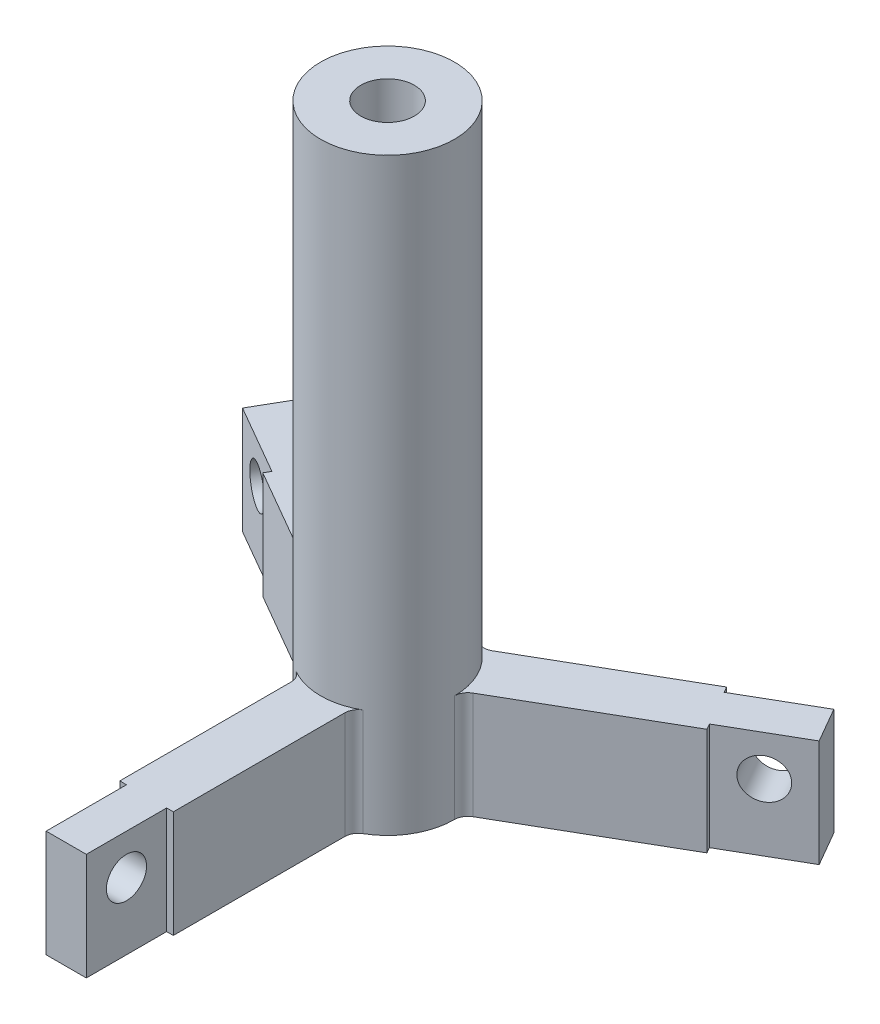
ISO-10303-21;
HEADER;
FILE_DESCRIPTION(('STEP AP214'),'2;1');
FILE_NAME('part.step','',(''),(''),'','','');
FILE_SCHEMA(('AUTOMOTIVE_DESIGN { 1 0 10303 214 1 1 1 1 }'));
ENDSEC;
DATA;
#1=APPLICATION_CONTEXT('core data for automotive mechanical design processes');
#2=APPLICATION_PROTOCOL_DEFINITION('international standard','automotive_design',2000,#1);
#3=PRODUCT_CONTEXT('',#1,'mechanical');
#4=PRODUCT('Part','Part','',(#3));
#5=PRODUCT_RELATED_PRODUCT_CATEGORY('part','',(#4));
#6=PRODUCT_DEFINITION_FORMATION('','',#4);
#7=PRODUCT_DEFINITION_CONTEXT('part definition',#1,'design');
#8=PRODUCT_DEFINITION('design','',#6,#7);
#9=PRODUCT_DEFINITION_SHAPE('','',#8);
#10=(LENGTH_UNIT() NAMED_UNIT(*) SI_UNIT(.MILLI.,.METRE.));
#11=(NAMED_UNIT(*) PLANE_ANGLE_UNIT() SI_UNIT($,.RADIAN.));
#12=(NAMED_UNIT(*) SI_UNIT($,.STERADIAN.) SOLID_ANGLE_UNIT());
#13=UNCERTAINTY_MEASURE_WITH_UNIT(LENGTH_MEASURE(1.E-05),#10,'distance_accuracy_value','');
#14=(GEOMETRIC_REPRESENTATION_CONTEXT(3) GLOBAL_UNCERTAINTY_ASSIGNED_CONTEXT((#13)) GLOBAL_UNIT_ASSIGNED_CONTEXT((#10,
#11,#12)) REPRESENTATION_CONTEXT('',''));
#15=CARTESIAN_POINT('',(0.,0.,0.));
#16=DIRECTION('',(0.,0.,1.));
#17=DIRECTION('',(1.,0.,0.));
#18=AXIS2_PLACEMENT_3D('',#15,#16,#17);
#19=CARTESIAN_POINT('',(0.,118.223731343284,0.));
#20=DIRECTION('',(0.,1.,0.));
#21=DIRECTION('',(0.,0.,1.));
#22=AXIS2_PLACEMENT_3D('',#19,#20,#21);
#23=CYLINDRICAL_SURFACE('',#22,15.875);
#24=CARTESIAN_POINT('',(0.,139.7,0.));
#25=DIRECTION('',(0.,1.,0.));
#26=DIRECTION('',(0.,0.,1.));
#27=AXIS2_PLACEMENT_3D('',#24,#25,#26);
#28=CIRCLE('',#27,15.875);
#29=CARTESIAN_POINT('',(0.,139.7,15.875));
#30=VERTEX_POINT('',#29);
#31=EDGE_CURVE('E432',#30,#30,#28,.T.);
#32=ORIENTED_EDGE('',*,*,#31,.F.);
#33=EDGE_LOOP('',(#32));
#34=FACE_BOUND('',#33,.T.);
#35=CARTESIAN_POINT('',(0.,25.4,0.));
#36=DIRECTION('',(0.,1.,0.));
#37=DIRECTION('',(0.,0.,1.));
#38=AXIS2_PLACEMENT_3D('',#35,#36,#37);
#39=CIRCLE('',#38,15.875);
#40=CARTESIAN_POINT('',(7.93750000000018,25.4,-13.7481532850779));
#41=VERTEX_POINT('',#40);
#42=CARTESIAN_POINT('',(15.875,25.4,1.50342701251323E-13));
#43=VERTEX_POINT('',#42);
#44=EDGE_CURVE('E434',#41,#43,#39,.F.);
#45=ORIENTED_EDGE('',*,*,#44,.F.);
#46=DIRECTION('',(0.,1.,0.));
#47=VECTOR('',#46,1.);
#48=CARTESIAN_POINT('',(7.93750000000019,118.223731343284,-13.7481532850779));
#49=LINE('',#48,#47);
#50=CARTESIAN_POINT('',(7.93750000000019,0.,-13.7481532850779));
#51=VERTEX_POINT('',#50);
#52=EDGE_CURVE('E437',#41,#51,#49,.F.);
#53=ORIENTED_EDGE('',*,*,#52,.T.);
#54=CARTESIAN_POINT('',(0.,0.,0.));
#55=DIRECTION('',(0.,1.,0.));
#56=DIRECTION('',(0.,0.,1.));
#57=AXIS2_PLACEMENT_3D('',#54,#55,#56);
#58=CIRCLE('',#57,15.875);
#59=CARTESIAN_POINT('',(-7.93749999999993,0.,-13.748153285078));
#60=VERTEX_POINT('',#59);
#61=EDGE_CURVE('E472',#51,#60,#58,.T.);
#62=ORIENTED_EDGE('',*,*,#61,.T.);
#63=DIRECTION('',(0.,1.,0.));
#64=VECTOR('',#63,1.);
#65=CARTESIAN_POINT('',(-7.93749999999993,118.223731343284,-13.748153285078));
#66=LINE('',#65,#64);
#67=CARTESIAN_POINT('',(-7.93749999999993,25.4,-13.748153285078));
#68=VERTEX_POINT('',#67);
#69=EDGE_CURVE('E666',#60,#68,#66,.T.);
#70=ORIENTED_EDGE('',*,*,#69,.T.);
#71=CARTESIAN_POINT('',(0.,25.4,0.));
#72=DIRECTION('',(0.,1.,0.));
#73=DIRECTION('',(0.,0.,1.));
#74=AXIS2_PLACEMENT_3D('',#71,#72,#73);
#75=CIRCLE('',#74,15.875);
#76=CARTESIAN_POINT('',(-15.875,25.4,-1.38777878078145E-13));
#77=VERTEX_POINT('',#76);
#78=EDGE_CURVE('E562',#77,#68,#75,.F.);
#79=ORIENTED_EDGE('',*,*,#78,.F.);
#80=DIRECTION('',(0.,1.,0.));
#81=VECTOR('',#80,1.);
#82=CARTESIAN_POINT('',(-15.875,118.223731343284,-1.38777878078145E-13));
#83=LINE('',#82,#81);
#84=CARTESIAN_POINT('',(-15.875,0.,-1.38777878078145E-13));
#85=VERTEX_POINT('',#84);
#86=EDGE_CURVE('E669',#77,#85,#83,.F.);
#87=ORIENTED_EDGE('',*,*,#86,.T.);
#88=CARTESIAN_POINT('',(-7.93750000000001,0.,13.748153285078));
#89=VERTEX_POINT('',#88);
#90=EDGE_CURVE('E474',#85,#89,#58,.T.);
#91=ORIENTED_EDGE('',*,*,#90,.T.);
#92=DIRECTION('',(0.,1.,0.));
#93=VECTOR('',#92,1.);
#94=CARTESIAN_POINT('',(-7.93750000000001,118.223731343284,13.748153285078));
#95=LINE('',#94,#93);
#96=CARTESIAN_POINT('',(-7.93750000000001,25.4,13.748153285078));
#97=VERTEX_POINT('',#96);
#98=EDGE_CURVE('E638',#89,#97,#95,.T.);
#99=ORIENTED_EDGE('',*,*,#98,.T.);
#100=CARTESIAN_POINT('',(0.,25.4,0.));
#101=DIRECTION('',(0.,1.,0.));
#102=DIRECTION('',(-1.,0.,0.));
#103=AXIS2_PLACEMENT_3D('',#100,#101,#102);
#104=CIRCLE('',#103,15.875);
#105=CARTESIAN_POINT('',(7.93749999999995,25.4,13.748153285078));
#106=VERTEX_POINT('',#105);
#107=EDGE_CURVE('E614',#106,#97,#104,.F.);
#108=ORIENTED_EDGE('',*,*,#107,.F.);
#109=DIRECTION('',(0.,1.,0.));
#110=VECTOR('',#109,1.);
#111=CARTESIAN_POINT('',(7.93749999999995,118.223731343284,13.748153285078));
#112=LINE('',#111,#110);
#113=CARTESIAN_POINT('',(7.93749999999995,0.,13.748153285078));
#114=VERTEX_POINT('',#113);
#115=EDGE_CURVE('E470',#106,#114,#112,.F.);
#116=ORIENTED_EDGE('',*,*,#115,.T.);
#117=CARTESIAN_POINT('',(15.875,0.,1.50342701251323E-13));
#118=VERTEX_POINT('',#117);
#119=EDGE_CURVE('E465',#114,#118,#58,.T.);
#120=ORIENTED_EDGE('',*,*,#119,.T.);
#121=DIRECTION('',(0.,1.,0.));
#122=VECTOR('',#121,1.);
#123=CARTESIAN_POINT('',(15.875,118.223731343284,1.50342701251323E-13));
#124=LINE('',#123,#122);
#125=EDGE_CURVE('E440',#118,#43,#124,.T.);
#126=ORIENTED_EDGE('',*,*,#125,.T.);
#127=EDGE_LOOP('',(#45,#53,#62,#70,#79,#87,#91,#99,#108,#116,#120,#126));
#128=FACE_BOUND('',#127,.T.);
#129=CARTESIAN_POINT('',(-4.44500000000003,44.6761600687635,-15.24));
#130=CARTESIAN_POINT('',(-4.27365940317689,44.7919882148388,-15.2899937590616));
#131=CARTESIAN_POINT('',(-4.09740061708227,44.9013550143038,-15.3382484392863));
#132=CARTESIAN_POINT('',(-3.73589018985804,45.106439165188,-15.4302753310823));
#133=CARTESIAN_POINT('',(-3.550634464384,45.202150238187,-15.4740454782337));
#134=CARTESIAN_POINT('',(-3.17161952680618,45.3793283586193,-15.5561624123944));
#135=CARTESIAN_POINT('',(-2.97783862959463,45.4607560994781,-15.5944941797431));
#136=CARTESIAN_POINT('',(-2.58340948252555,45.6082769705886,-15.664664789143));
#137=CARTESIAN_POINT('',(-2.38276229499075,45.6743724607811,-15.6965046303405));
#138=CARTESIAN_POINT('',(-1.97521023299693,45.7907413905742,-15.7529878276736));
#139=CARTESIAN_POINT('',(-1.76828712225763,45.8409626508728,-15.7776074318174));
#140=CARTESIAN_POINT('',(-1.35030485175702,45.9247049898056,-15.8188620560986));
#141=CARTESIAN_POINT('',(-1.13924584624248,45.9582266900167,-15.8354973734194));
#142=CARTESIAN_POINT('',(-0.715040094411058,46.0081060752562,-15.8603087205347));
#143=CARTESIAN_POINT('',(-0.501898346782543,46.0244978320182,-15.868501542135));
#144=CARTESIAN_POINT('',(-0.0748396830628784,46.0400222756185,-15.8762598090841));
#145=CARTESIAN_POINT('',(0.139077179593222,46.0391561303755,-15.8758258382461));
#146=CARTESIAN_POINT('',(0.554297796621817,46.0206985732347,-15.8666042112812));
#147=CARTESIAN_POINT('',(0.755653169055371,46.0040219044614,-15.8582734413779));
#148=CARTESIAN_POINT('',(1.15606143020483,45.9554505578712,-15.8341207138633));
#149=CARTESIAN_POINT('',(1.35511431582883,45.9235558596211,-15.8182987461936));
#150=CARTESIAN_POINT('',(1.749838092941,45.8448382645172,-15.7795140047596));
#151=CARTESIAN_POINT('',(1.9455037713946,45.7979941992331,-15.756541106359));
#152=CARTESIAN_POINT('',(2.3318386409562,45.6899084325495,-15.7040189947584));
#153=CARTESIAN_POINT('',(2.52250833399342,45.6286681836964,-15.6744704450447));
#154=CARTESIAN_POINT('',(3.01891528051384,45.44831704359,-15.5884469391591));
#155=CARTESIAN_POINT('',(3.31959750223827,45.3173490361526,-15.5268931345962));
#156=CARTESIAN_POINT('',(3.75439451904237,45.095348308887,-15.4253797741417));
#157=CARTESIAN_POINT('',(3.89642363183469,45.0172247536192,-15.3900707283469));
#158=CARTESIAN_POINT('',(4.17493913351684,44.8527689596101,-15.3168601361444));
#159=CARTESIAN_POINT('',(4.31142599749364,44.7664374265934,-15.2789588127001));
#160=CARTESIAN_POINT('',(4.44500000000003,44.6761600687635,-15.24));
#161=B_SPLINE_CURVE_WITH_KNOTS('',3,(#129,#130,#131,#132,#133,#134,#135,#136,#137,#138,#139,
#140,#141,#142,#143,#144,#145,#146,#147,#148,#149,#150,#151,#152,#153,#154,#155,#156,#157,#158,
#159,#160),.UNSPECIFIED.,.F.,.F.,(4,2,2,2,2,2,2,2,2,2,2,2,2,2,2,4),(0.,0.63821581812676,
1.27672412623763,1.91696289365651,2.55710305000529,3.19932600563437,3.84152505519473,
4.48244431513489,5.12332020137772,5.7292438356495,6.33516828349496,6.94195456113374,
7.54867964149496,8.54651166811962,9.04395316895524,9.5413519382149),.UNSPECIFIED.);
#162=CARTESIAN_POINT('',(-4.44500000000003,44.6761600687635,-15.24));
#163=VERTEX_POINT('',#162);
#164=CARTESIAN_POINT('',(4.44500000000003,44.6761600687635,-15.24));
#165=VERTEX_POINT('',#164);
#166=EDGE_CURVE('E243',#163,#165,#161,.T.);
#167=ORIENTED_EDGE('',*,*,#166,.F.);
#168=DIRECTION('',(0.,1.,0.));
#169=VECTOR('',#168,1.);
#170=CARTESIAN_POINT('',(-4.44500000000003,118.223731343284,-15.24));
#171=LINE('',#170,#169);
#172=CARTESIAN_POINT('',(-4.44500000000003,31.5238399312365,-15.24));
#173=VERTEX_POINT('',#172);
#174=EDGE_CURVE('E40',#163,#173,#171,.F.);
#175=ORIENTED_EDGE('',*,*,#174,.T.);
#176=CARTESIAN_POINT('',(4.44500000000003,31.5238399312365,-15.24));
#177=CARTESIAN_POINT('',(4.27365940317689,31.4080117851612,-15.2899937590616));
#178=CARTESIAN_POINT('',(4.09740061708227,31.2986449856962,-15.3382484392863));
#179=CARTESIAN_POINT('',(3.73589018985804,31.093560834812,-15.4302753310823));
#180=CARTESIAN_POINT('',(3.55063446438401,30.997849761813,-15.4740454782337));
#181=CARTESIAN_POINT('',(3.17161952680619,30.8206716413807,-15.5561624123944));
#182=CARTESIAN_POINT('',(2.97783862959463,30.7392439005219,-15.5944941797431));
#183=CARTESIAN_POINT('',(2.58340948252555,30.5917230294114,-15.664664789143));
#184=CARTESIAN_POINT('',(2.38276229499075,30.5256275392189,-15.6965046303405));
#185=CARTESIAN_POINT('',(1.97521023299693,30.4092586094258,-15.7529878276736));
#186=CARTESIAN_POINT('',(1.76828712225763,30.3590373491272,-15.7776074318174));
#187=CARTESIAN_POINT('',(1.35030485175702,30.2752950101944,-15.8188620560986));
#188=CARTESIAN_POINT('',(1.13924584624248,30.2417733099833,-15.8354973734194));
#189=CARTESIAN_POINT('',(0.715040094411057,30.1918939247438,-15.8603087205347));
#190=CARTESIAN_POINT('',(0.501898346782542,30.1755021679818,-15.868501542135));
#191=CARTESIAN_POINT('',(0.0748396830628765,30.1599777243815,-15.8762598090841));
#192=CARTESIAN_POINT('',(-0.139077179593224,30.1608438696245,-15.8758258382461));
#193=CARTESIAN_POINT('',(-0.554297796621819,30.1793014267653,-15.8666042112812));
#194=CARTESIAN_POINT('',(-0.755653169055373,30.1959780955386,-15.8582734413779));
#195=CARTESIAN_POINT('',(-1.15606143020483,30.2445494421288,-15.8341207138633));
#196=CARTESIAN_POINT('',(-1.35511431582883,30.2764441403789,-15.8182987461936));
#197=CARTESIAN_POINT('',(-1.749838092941,30.3551617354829,-15.7795140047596));
#198=CARTESIAN_POINT('',(-1.9455037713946,30.4020058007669,-15.756541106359));
#199=CARTESIAN_POINT('',(-2.3318386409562,30.5100915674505,-15.7040189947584));
#200=CARTESIAN_POINT('',(-2.52250833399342,30.5713318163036,-15.6744704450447));
#201=CARTESIAN_POINT('',(-3.01891528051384,30.75168295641,-15.5884469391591));
#202=CARTESIAN_POINT('',(-3.31959750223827,30.8826509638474,-15.5268931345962));
#203=CARTESIAN_POINT('',(-3.75439451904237,31.104651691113,-15.4253797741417));
#204=CARTESIAN_POINT('',(-3.89642363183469,31.1827752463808,-15.3900707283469));
#205=CARTESIAN_POINT('',(-4.17493913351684,31.3472310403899,-15.3168601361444));
#206=CARTESIAN_POINT('',(-4.31142599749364,31.4335625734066,-15.2789588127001));
#207=CARTESIAN_POINT('',(-4.44500000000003,31.5238399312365,-15.24));
#208=B_SPLINE_CURVE_WITH_KNOTS('',3,(#176,#177,#178,#179,#180,#181,#182,#183,#184,#185,#186,
#187,#188,#189,#190,#191,#192,#193,#194,#195,#196,#197,#198,#199,#200,#201,#202,#203,#204,#205,
#206,#207),.UNSPECIFIED.,.F.,.F.,(4,2,2,2,2,2,2,2,2,2,2,2,2,2,2,4),(0.,0.638215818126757,
1.27672412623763,1.91696289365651,2.55710305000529,3.19932600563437,3.84152505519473,
4.48244431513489,5.12332020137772,5.7292438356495,6.33516828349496,6.94195456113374,
7.54867964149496,8.54651166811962,9.04395316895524,9.5413519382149),.UNSPECIFIED.);
#209=CARTESIAN_POINT('',(4.44500000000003,31.5238399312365,-15.24));
#210=VERTEX_POINT('',#209);
#211=EDGE_CURVE('E249',#210,#173,#208,.T.);
#212=ORIENTED_EDGE('',*,*,#211,.F.);
#213=DIRECTION('',(0.,1.,0.));
#214=VECTOR('',#213,1.);
#215=CARTESIAN_POINT('',(4.44500000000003,118.223731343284,-15.24));
#216=LINE('',#215,#214);
#217=EDGE_CURVE('E11',#210,#165,#216,.T.);
#218=ORIENTED_EDGE('',*,*,#217,.T.);
#219=EDGE_LOOP('',(#167,#175,#212,#218));
#220=FACE_BOUND('',#219,.T.);
#221=ADVANCED_FACE('F32',(#34,#128,#220),#23,.T.);
#222=CARTESIAN_POINT('',(15.875,0.,0.));
#223=DIRECTION('',(0.,1.,0.));
#224=DIRECTION('',(0.,0.,1.));
#225=AXIS2_PLACEMENT_3D('',#222,#223,#224);
#226=PLANE('',#225);
#227=ORIENTED_EDGE('',*,*,#61,.F.);
#228=CARTESIAN_POINT('',(9.52500000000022,0.,-16.4977839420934));
#229=DIRECTION('',(0.,1.,0.));
#230=DIRECTION('',(0.,0.,1.));
#231=AXIS2_PLACEMENT_3D('',#228,#229,#230);
#232=CIRCLE('',#231,3.175);
#233=CARTESIAN_POINT('',(11.1125000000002,0.,-13.7481532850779));
#234=VERTEX_POINT('',#233);
#235=EDGE_CURVE('E452',#51,#234,#232,.T.);
#236=ORIENTED_EDGE('',*,*,#235,.T.);
#237=DIRECTION('',(0.866025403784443,0.,-0.499999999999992));
#238=VECTOR('',#237,1.);
#239=CARTESIAN_POINT('',(-87.4510402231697,0.,43.1575331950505));
#240=LINE('',#239,#238);
#241=CARTESIAN_POINT('',(46.318351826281,0.,-34.0742613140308));
#242=VERTEX_POINT('',#241);
#243=EDGE_CURVE('E484',#234,#242,#240,.T.);
#244=ORIENTED_EDGE('',*,*,#243,.T.);
#245=DIRECTION('',(-0.499999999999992,0.,-0.866025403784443));
#246=VECTOR('',#245,1.);
#247=CARTESIAN_POINT('',(46.318351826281,0.,-34.0742613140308));
#248=LINE('',#247,#246);
#249=CARTESIAN_POINT('',(47.112101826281,0.,-32.6994459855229));
#250=VERTEX_POINT('',#249);
#251=EDGE_CURVE('E487',#250,#242,#248,.T.);
#252=ORIENTED_EDGE('',*,*,#251,.F.);
#253=DIRECTION('',(0.866025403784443,0.,-0.499999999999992));
#254=VECTOR('',#253,1.);
#255=CARTESIAN_POINT('',(-47.2842508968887,0.,21.8003136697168));
#256=LINE('',#255,#254);
#257=CARTESIAN_POINT('',(63.6098857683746,0.,-42.2244459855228));
#258=VERTEX_POINT('',#257);
#259=EDGE_CURVE('E532',#250,#258,#256,.T.);
#260=ORIENTED_EDGE('',*,*,#259,.T.);
#261=DIRECTION('',(-0.499999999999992,0.,-0.866025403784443));
#262=VECTOR('',#261,1.);
#263=CARTESIAN_POINT('',(68.3723857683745,0.,-33.975554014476));
#264=LINE('',#263,#262);
#265=CARTESIAN_POINT('',(68.3723857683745,0.,-33.975554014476));
#266=VERTEX_POINT('',#265);
#267=EDGE_CURVE('E536',#266,#258,#264,.T.);
#268=ORIENTED_EDGE('',*,*,#267,.F.);
#269=DIRECTION('',(0.866025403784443,0.,-0.499999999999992));
#270=VECTOR('',#269,1.);
#271=CARTESIAN_POINT('',(-42.5217508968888,0.,30.0492056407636));
#272=LINE('',#271,#270);
#273=CARTESIAN_POINT('',(51.8746018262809,0.,-24.4505540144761));
#274=VERTEX_POINT('',#273);
#275=EDGE_CURVE('E541',#274,#266,#272,.T.);
#276=ORIENTED_EDGE('',*,*,#275,.F.);
#277=CARTESIAN_POINT('',(52.6683518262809,0.,-23.0757386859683));
#278=VERTEX_POINT('',#277);
#279=EDGE_CURVE('E482',#278,#274,#248,.T.);
#280=ORIENTED_EDGE('',*,*,#279,.F.);
#281=DIRECTION('',(0.866025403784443,0.,-0.499999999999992));
#282=VECTOR('',#281,1.);
#283=CARTESIAN_POINT('',(-81.1010402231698,0.,54.156055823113));
#284=LINE('',#283,#282);
#285=CARTESIAN_POINT('',(17.4625,0.,-2.74963065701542));
#286=VERTEX_POINT('',#285);
#287=EDGE_CURVE('E468',#286,#278,#284,.T.);
#288=ORIENTED_EDGE('',*,*,#287,.F.);
#289=CARTESIAN_POINT('',(19.05,0.,1.80411241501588E-13));
#290=DIRECTION('',(0.,1.,0.));
#291=DIRECTION('',(0.,0.,1.));
#292=AXIS2_PLACEMENT_3D('',#289,#290,#291);
#293=CIRCLE('',#292,3.175);
#294=EDGE_CURVE('E55',#286,#118,#293,.T.);
#295=ORIENTED_EDGE('',*,*,#294,.T.);
#296=ORIENTED_EDGE('',*,*,#119,.F.);
#297=CARTESIAN_POINT('',(9.52499999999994,0.,16.4977839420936));
#298=DIRECTION('',(0.,1.,0.));
#299=DIRECTION('',(0.,0.,1.));
#300=AXIS2_PLACEMENT_3D('',#297,#298,#299);
#301=CIRCLE('',#300,3.175);
#302=CARTESIAN_POINT('',(6.35000000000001,0.,16.4977839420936));
#303=VERTEX_POINT('',#302);
#304=EDGE_CURVE('E648',#114,#303,#301,.T.);
#305=ORIENTED_EDGE('',*,*,#304,.T.);
#306=DIRECTION('',(0.,0.,1.));
#307=VECTOR('',#306,1.);
#308=CARTESIAN_POINT('',(6.35000000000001,0.,-15.876));
#309=LINE('',#308,#307);
#310=CARTESIAN_POINT('',(6.35000000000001,0.,57.15));
#311=VERTEX_POINT('',#310);
#312=EDGE_CURVE('E585',#303,#311,#309,.T.);
#313=ORIENTED_EDGE('',*,*,#312,.T.);
#314=DIRECTION('',(1.,0.,0.));
#315=VECTOR('',#314,1.);
#316=CARTESIAN_POINT('',(6.35000000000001,0.,57.15));
#317=LINE('',#316,#315);
#318=CARTESIAN_POINT('',(4.7625,0.,57.15));
#319=VERTEX_POINT('',#318);
#320=EDGE_CURVE('E573',#319,#311,#317,.T.);
#321=ORIENTED_EDGE('',*,*,#320,.F.);
#322=DIRECTION('',(0.,0.,1.));
#323=VECTOR('',#322,1.);
#324=CARTESIAN_POINT('',(4.7625,0.,-15.876));
#325=LINE('',#324,#323);
#326=CARTESIAN_POINT('',(4.7625,0.,76.2));
#327=VERTEX_POINT('',#326);
#328=EDGE_CURVE('E599',#319,#327,#325,.T.);
#329=ORIENTED_EDGE('',*,*,#328,.T.);
#330=DIRECTION('',(1.,0.,0.));
#331=VECTOR('',#330,1.);
#332=CARTESIAN_POINT('',(-4.7625,0.,76.2));
#333=LINE('',#332,#331);
#334=CARTESIAN_POINT('',(-4.7625,0.,76.2));
#335=VERTEX_POINT('',#334);
#336=EDGE_CURVE('E603',#335,#327,#333,.T.);
#337=ORIENTED_EDGE('',*,*,#336,.F.);
#338=DIRECTION('',(0.,0.,1.));
#339=VECTOR('',#338,1.);
#340=CARTESIAN_POINT('',(-4.7625,0.,-15.876));
#341=LINE('',#340,#339);
#342=CARTESIAN_POINT('',(-4.7625,0.,57.15));
#343=VERTEX_POINT('',#342);
#344=EDGE_CURVE('E609',#343,#335,#341,.T.);
#345=ORIENTED_EDGE('',*,*,#344,.F.);
#346=CARTESIAN_POINT('',(-6.35000000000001,0.,57.15));
#347=VERTEX_POINT('',#346);
#348=EDGE_CURVE('E569',#347,#343,#317,.T.);
#349=ORIENTED_EDGE('',*,*,#348,.F.);
#350=DIRECTION('',(0.,0.,1.));
#351=VECTOR('',#350,1.);
#352=CARTESIAN_POINT('',(-6.35000000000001,0.,-15.876));
#353=LINE('',#352,#351);
#354=CARTESIAN_POINT('',(-6.35000000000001,0.,16.4977839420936));
#355=VERTEX_POINT('',#354);
#356=EDGE_CURVE('E587',#355,#347,#353,.T.);
#357=ORIENTED_EDGE('',*,*,#356,.F.);
#358=CARTESIAN_POINT('',(-9.52500000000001,0.,16.4977839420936));
#359=DIRECTION('',(0.,1.,0.));
#360=DIRECTION('',(0.,0.,1.));
#361=AXIS2_PLACEMENT_3D('',#358,#359,#360);
#362=CIRCLE('',#361,3.175);
#363=EDGE_CURVE('E650',#355,#89,#362,.T.);
#364=ORIENTED_EDGE('',*,*,#363,.T.);
#365=ORIENTED_EDGE('',*,*,#90,.F.);
#366=CARTESIAN_POINT('',(-19.05,0.,-1.66533453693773E-13));
#367=DIRECTION('',(0.,1.,0.));
#368=DIRECTION('',(0.,0.,1.));
#369=AXIS2_PLACEMENT_3D('',#366,#367,#368);
#370=CIRCLE('',#369,3.175);
#371=CARTESIAN_POINT('',(-17.4625,0.,-2.74963065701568));
#372=VERTEX_POINT('',#371);
#373=EDGE_CURVE('E677',#85,#372,#370,.T.);
#374=ORIENTED_EDGE('',*,*,#373,.T.);
#375=DIRECTION('',(-0.866025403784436,0.,-0.500000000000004));
#376=VECTOR('',#375,1.);
#377=CARTESIAN_POINT('',(81.1010402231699,0.,54.1560558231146));
#378=LINE('',#377,#376);
#379=CARTESIAN_POINT('',(-52.6683518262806,0.,-23.0757386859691));
#380=VERTEX_POINT('',#379);
#381=EDGE_CURVE('E511',#372,#380,#378,.T.);
#382=ORIENTED_EDGE('',*,*,#381,.T.);
#383=DIRECTION('',(-0.500000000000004,0.,0.866025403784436));
#384=VECTOR('',#383,1.);
#385=CARTESIAN_POINT('',(-52.6683518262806,0.,-23.0757386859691));
#386=LINE('',#385,#384);
#387=CARTESIAN_POINT('',(-51.8746018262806,0.,-24.4505540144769));
#388=VERTEX_POINT('',#387);
#389=EDGE_CURVE('E498',#388,#380,#386,.T.);
#390=ORIENTED_EDGE('',*,*,#389,.F.);
#391=DIRECTION('',(-0.866025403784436,0.,-0.500000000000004));
#392=VECTOR('',#391,1.);
#393=CARTESIAN_POINT('',(42.5217508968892,0.,30.0492056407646));
#394=LINE('',#393,#392);
#395=CARTESIAN_POINT('',(-68.3723857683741,0.,-33.9755540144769));
#396=VERTEX_POINT('',#395);
#397=EDGE_CURVE('E560',#388,#396,#394,.T.);
#398=ORIENTED_EDGE('',*,*,#397,.T.);
#399=DIRECTION('',(-0.500000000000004,0.,0.866025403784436));
#400=VECTOR('',#399,1.);
#401=CARTESIAN_POINT('',(-63.609885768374,0.,-42.2244459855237));
#402=LINE('',#401,#400);
#403=CARTESIAN_POINT('',(-63.609885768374,0.,-42.2244459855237));
#404=VERTEX_POINT('',#403);
#405=EDGE_CURVE('E554',#404,#396,#402,.T.);
#406=ORIENTED_EDGE('',*,*,#405,.F.);
#407=DIRECTION('',(-0.866025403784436,0.,-0.500000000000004));
#408=VECTOR('',#407,1.);
#409=CARTESIAN_POINT('',(47.2842508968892,0.,21.8003136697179));
#410=LINE('',#409,#408);
#411=CARTESIAN_POINT('',(-47.1121018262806,0.,-32.6994459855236));
#412=VERTEX_POINT('',#411);
#413=EDGE_CURVE('E543',#412,#404,#410,.T.);
#414=ORIENTED_EDGE('',*,*,#413,.F.);
#415=CARTESIAN_POINT('',(-46.3183518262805,0.,-34.0742613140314));
#416=VERTEX_POINT('',#415);
#417=EDGE_CURVE('E494',#416,#412,#386,.T.);
#418=ORIENTED_EDGE('',*,*,#417,.F.);
#419=DIRECTION('',(-0.866025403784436,0.,-0.500000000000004));
#420=VECTOR('',#419,1.);
#421=CARTESIAN_POINT('',(87.4510402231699,0.,43.1575331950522));
#422=LINE('',#421,#420);
#423=CARTESIAN_POINT('',(-11.1124999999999,0.,-13.748153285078));
#424=VERTEX_POINT('',#423);
#425=EDGE_CURVE('E513',#424,#416,#422,.T.);
#426=ORIENTED_EDGE('',*,*,#425,.F.);
#427=CARTESIAN_POINT('',(-9.52499999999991,0.,-16.4977839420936));
#428=DIRECTION('',(0.,1.,0.));
#429=DIRECTION('',(0.,0.,1.));
#430=AXIS2_PLACEMENT_3D('',#427,#428,#429);
#431=CIRCLE('',#430,3.175);
#432=EDGE_CURVE('E679',#424,#60,#431,.T.);
#433=ORIENTED_EDGE('',*,*,#432,.T.);
#434=EDGE_LOOP('',(#227,#236,#244,#252,#260,#268,#276,#280,#288,#295,#296,#305,#313,#321,#329,
#337,#345,#349,#357,#364,#365,#374,#382,#390,#398,#406,#414,#418,#426,#433));
#435=FACE_BOUND('',#434,.T.);
#436=CARTESIAN_POINT('',(0.,0.,0.));
#437=DIRECTION('',(0.,1.,0.));
#438=DIRECTION('',(0.,0.,1.));
#439=AXIS2_PLACEMENT_3D('',#436,#437,#438);
#440=CIRCLE('',#439,12.7);
#441=CARTESIAN_POINT('',(0.,0.,12.7));
#442=VERTEX_POINT('',#441);
#443=EDGE_CURVE('E611',#442,#442,#440,.T.);
#444=ORIENTED_EDGE('',*,*,#443,.T.);
#445=EDGE_LOOP('',(#444));
#446=FACE_BOUND('',#445,.T.);
#447=ADVANCED_FACE('F34',(#435,#446),#226,.F.);
#448=CARTESIAN_POINT('',(6.35000000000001,139.7,0.));
#449=DIRECTION('',(0.,-1.,0.));
#450=DIRECTION('',(0.,0.,-1.));
#451=AXIS2_PLACEMENT_3D('',#448,#449,#450);
#452=PLANE('',#451);
#453=CARTESIAN_POINT('',(0.,139.7,0.));
#454=DIRECTION('',(0.,1.,0.));
#455=DIRECTION('',(0.,0.,1.));
#456=AXIS2_PLACEMENT_3D('',#453,#454,#455);
#457=CIRCLE('',#456,6.35000000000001);
#458=CARTESIAN_POINT('',(0.,139.7,6.35000000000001));
#459=VERTEX_POINT('',#458);
#460=EDGE_CURVE('E627',#459,#459,#457,.T.);
#461=ORIENTED_EDGE('',*,*,#460,.F.);
#462=EDGE_LOOP('',(#461));
#463=FACE_BOUND('',#462,.T.);
#464=ORIENTED_EDGE('',*,*,#31,.T.);
#465=EDGE_LOOP('',(#464));
#466=FACE_BOUND('',#465,.T.);
#467=ADVANCED_FACE('F427',(#463,#466),#452,.F.);
#468=CARTESIAN_POINT('',(0.,118.223731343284,0.));
#469=DIRECTION('',(0.,1.,0.));
#470=DIRECTION('',(0.,0.,1.));
#471=AXIS2_PLACEMENT_3D('',#468,#469,#470);
#472=CYLINDRICAL_SURFACE('',#471,6.35000000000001);
#473=CARTESIAN_POINT('',(0.,127.,0.));
#474=DIRECTION('',(0.,1.,0.));
#475=DIRECTION('',(0.,0.,1.));
#476=AXIS2_PLACEMENT_3D('',#473,#474,#475);
#477=CIRCLE('',#476,6.35000000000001);
#478=CARTESIAN_POINT('',(0.,127.,6.35000000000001));
#479=VERTEX_POINT('',#478);
#480=EDGE_CURVE('E624',#479,#479,#477,.T.);
#481=ORIENTED_EDGE('',*,*,#480,.F.);
#482=EDGE_LOOP('',(#481));
#483=FACE_BOUND('',#482,.T.);
#484=ORIENTED_EDGE('',*,*,#460,.T.);
#485=EDGE_LOOP('',(#484));
#486=FACE_BOUND('',#485,.T.);
#487=ADVANCED_FACE('F929',(#483,#486),#472,.F.);
#488=CARTESIAN_POINT('',(12.7,127.,0.));
#489=DIRECTION('',(0.,1.,0.));
#490=DIRECTION('',(0.,0.,1.));
#491=AXIS2_PLACEMENT_3D('',#488,#489,#490);
#492=PLANE('',#491);
#493=CARTESIAN_POINT('',(0.,127.,0.));
#494=DIRECTION('',(0.,1.,0.));
#495=DIRECTION('',(0.,0.,1.));
#496=AXIS2_PLACEMENT_3D('',#493,#494,#495);
#497=CIRCLE('',#496,12.7);
#498=CARTESIAN_POINT('',(0.,127.,12.7));
#499=VERTEX_POINT('',#498);
#500=EDGE_CURVE('E621',#499,#499,#497,.T.);
#501=ORIENTED_EDGE('',*,*,#500,.F.);
#502=EDGE_LOOP('',(#501));
#503=FACE_BOUND('',#502,.T.);
#504=ORIENTED_EDGE('',*,*,#480,.T.);
#505=EDGE_LOOP('',(#504));
#506=FACE_BOUND('',#505,.T.);
#507=ADVANCED_FACE('F401',(#503,#506),#492,.F.);
#508=CARTESIAN_POINT('',(0.,118.223731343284,0.));
#509=DIRECTION('',(0.,1.,0.));
#510=DIRECTION('',(0.,0.,1.));
#511=AXIS2_PLACEMENT_3D('',#508,#509,#510);
#512=CYLINDRICAL_SURFACE('',#511,12.7);
#513=CARTESIAN_POINT('',(-3.175,38.1,-12.2967221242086));
#514=CARTESIAN_POINT('',(-3.1749950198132,38.2753244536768,-12.2967254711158));
#515=CARTESIAN_POINT('',(-3.16042833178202,38.4507040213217,-12.3005126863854));
#516=CARTESIAN_POINT('',(-3.10263936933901,38.7964268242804,-12.3152136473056));
#517=CARTESIAN_POINT('',(-3.05940041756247,38.9667670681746,-12.3261315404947));
#518=CARTESIAN_POINT('',(-2.94575382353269,39.2973604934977,-12.3537818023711));
#519=CARTESIAN_POINT('',(-2.8753812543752,39.4576263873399,-12.3705066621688));
#520=CARTESIAN_POINT('',(-2.70957184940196,39.7640947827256,-12.4078770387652));
#521=CARTESIAN_POINT('',(-2.61413394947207,39.9102966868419,-12.4285227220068));
#522=CARTESIAN_POINT('',(-2.39865970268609,40.187704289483,-12.4719170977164));
#523=CARTESIAN_POINT('',(-2.27817284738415,40.3185548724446,-12.4946993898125));
#524=CARTESIAN_POINT('',(-2.01699122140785,40.5584169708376,-12.5395085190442));
#525=CARTESIAN_POINT('',(-1.87629456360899,40.6674264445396,-12.5615352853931));
#526=CARTESIAN_POINT('',(-1.57625440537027,40.8619648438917,-12.6027232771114));
#527=CARTESIAN_POINT('',(-1.4166781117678,40.9471449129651,-12.6218402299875));
#528=CARTESIAN_POINT('',(-1.08491424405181,41.0893382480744,-12.65467131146));
#529=CARTESIAN_POINT('',(-0.912728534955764,41.1463556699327,-12.6683862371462));
#530=CARTESIAN_POINT('',(-0.564335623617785,41.2294677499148,-12.6886304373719));
#531=CARTESIAN_POINT('',(-0.388280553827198,41.2561654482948,-12.6952996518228));
#532=CARTESIAN_POINT('',(-0.0340726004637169,41.27977314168,-12.7011886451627));
#533=CARTESIAN_POINT('',(0.144079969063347,41.2766875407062,-12.7004095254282));
#534=CARTESIAN_POINT('',(0.493243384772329,41.2412499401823,-12.6915938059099));
#535=CARTESIAN_POINT('',(0.664324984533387,41.2095488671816,-12.6837186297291));
#536=CARTESIAN_POINT('',(0.998658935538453,41.1188264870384,-12.6617836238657));
#537=CARTESIAN_POINT('',(1.16191086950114,41.0598037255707,-12.6477234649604));
#538=CARTESIAN_POINT('',(1.47766628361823,40.9155867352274,-12.6147513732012));
#539=CARTESIAN_POINT('',(1.63005931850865,40.8301608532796,-12.5957967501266));
#540=CARTESIAN_POINT('',(1.91857510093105,40.6357382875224,-12.5550917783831));
#541=CARTESIAN_POINT('',(2.05469501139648,40.526737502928,-12.5333409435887));
#542=CARTESIAN_POINT('',(2.31068256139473,40.2847698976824,-12.4887191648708));
#543=CARTESIAN_POINT('',(2.43001063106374,40.1512342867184,-12.4658338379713));
#544=CARTESIAN_POINT('',(2.64469999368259,39.8658080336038,-12.4220610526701));
#545=CARTESIAN_POINT('',(2.74006016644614,39.7139165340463,-12.4011736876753));
#546=CARTESIAN_POINT('',(2.90445230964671,39.3950316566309,-12.3637103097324));
#547=CARTESIAN_POINT('',(2.97335437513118,39.2279686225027,-12.347155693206));
#548=CARTESIAN_POINT('',(3.08192684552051,38.8841164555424,-12.3205067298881));
#549=CARTESIAN_POINT('',(3.12160350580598,38.7073294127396,-12.3104110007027));
#550=CARTESIAN_POINT('',(3.16970364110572,38.354051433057,-12.2981130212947));
#551=CARTESIAN_POINT('',(3.17892490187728,38.1776760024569,-12.2957093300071));
#552=CARTESIAN_POINT('',(3.16803657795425,37.8259061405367,-12.2985192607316));
#553=CARTESIAN_POINT('',(3.14792969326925,37.6505116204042,-12.3037321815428));
#554=CARTESIAN_POINT('',(3.07965533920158,37.3086448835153,-12.3209949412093));
#555=CARTESIAN_POINT('',(3.03195236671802,37.1420736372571,-12.3329315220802));
#556=CARTESIAN_POINT('',(2.91035496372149,36.8192920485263,-12.3621891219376));
#557=CARTESIAN_POINT('',(2.83645743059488,36.6630829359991,-12.3795107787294));
#558=CARTESIAN_POINT('',(2.66289874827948,36.362079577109,-12.418010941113));
#559=CARTESIAN_POINT('',(2.56276062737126,36.2175693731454,-12.439258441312));
#560=CARTESIAN_POINT('',(2.34016643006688,35.9471107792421,-12.4830469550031));
#561=CARTESIAN_POINT('',(2.21770668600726,35.8211654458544,-12.5055881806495));
#562=CARTESIAN_POINT('',(1.95028413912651,35.5881799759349,-12.5501070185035));
#563=CARTESIAN_POINT('',(1.80483494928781,35.481691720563,-12.5720564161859));
#564=CARTESIAN_POINT('',(1.49765601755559,35.2946514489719,-12.6123346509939));
#565=CARTESIAN_POINT('',(1.33592712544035,35.2140980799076,-12.6306636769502));
#566=CARTESIAN_POINT('',(1.00189729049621,35.0819135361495,-12.6615204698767));
#567=CARTESIAN_POINT('',(0.829682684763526,35.0300743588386,-12.6740898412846));
#568=CARTESIAN_POINT('',(0.478630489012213,34.9561653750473,-12.6921932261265));
#569=CARTESIAN_POINT('',(0.299794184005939,34.9340898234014,-12.6977285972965));
#570=CARTESIAN_POINT('',(-0.0542401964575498,34.9206579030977,-12.7010848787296));
#571=CARTESIAN_POINT('',(-0.229405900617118,34.9284870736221,-12.6991103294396));
#572=CARTESIAN_POINT('',(-0.575841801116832,34.9727768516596,-12.6881222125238));
#573=CARTESIAN_POINT('',(-0.747112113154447,35.0092366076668,-12.6791088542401));
#574=CARTESIAN_POINT('',(-1.08004303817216,35.1093157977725,-12.655087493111));
#575=CARTESIAN_POINT('',(-1.24175042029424,35.1727879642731,-12.640112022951));
#576=CARTESIAN_POINT('',(-1.55231164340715,35.3249565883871,-12.6057434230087));
#577=CARTESIAN_POINT('',(-1.70116386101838,35.4136562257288,-12.5863497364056));
#578=CARTESIAN_POINT('',(-1.98565112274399,35.6162458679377,-12.5446551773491));
#579=CARTESIAN_POINT('',(-2.12088408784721,35.7306884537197,-12.5222957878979));
#580=CARTESIAN_POINT('',(-2.37050268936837,35.9804425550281,-12.4774531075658));
#581=CARTESIAN_POINT('',(-2.48488303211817,36.1157593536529,-12.4549697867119));
#582=CARTESIAN_POINT('',(-2.69164443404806,36.4064594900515,-12.4119473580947));
#583=CARTESIAN_POINT('',(-2.78357526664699,36.5621700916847,-12.3914523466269));
#584=CARTESIAN_POINT('',(-2.93981789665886,36.8873261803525,-12.3553205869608));
#585=CARTESIAN_POINT('',(-3.00414978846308,37.056761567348,-12.3396803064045));
#586=CARTESIAN_POINT('',(-3.09379152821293,37.3715820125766,-12.3174731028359));
#587=CARTESIAN_POINT('',(-3.12417831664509,37.515460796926,-12.3097500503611));
#588=CARTESIAN_POINT('',(-3.16478377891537,37.8062136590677,-12.2993733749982));
#589=CARTESIAN_POINT('',(-3.17500417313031,37.953087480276,-12.2967193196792));
#590=CARTESIAN_POINT('',(-3.175,38.1,-12.2967221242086));
#591=B_SPLINE_CURVE_WITH_KNOTS('',3,(#513,#514,#515,#516,#517,#518,#519,#520,#521,#522,#523,
#524,#525,#526,#527,#528,#529,#530,#531,#532,#533,#534,#535,#536,#537,#538,#539,#540,#541,#542,
#543,#544,#545,#546,#547,#548,#549,#550,#551,#552,#553,#554,#555,#556,#557,#558,#559,#560,#561,
#562,#563,#564,#565,#566,#567,#568,#569,#570,#571,#572,#573,#574,#575,#576,#577,#578,#579,#580,
#581,#582,#583,#584,#585,#586,#587,#588,#589,#590),.UNSPECIFIED.,.T.,.F.,(4,2,2,2,2,2,2,2,2,2,2,
2,2,2,2,2,2,2,2,2,2,2,2,2,2,2,2,2,2,2,2,2,2,2,2,2,2,2,4),(0.,0.5254338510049,1.0511735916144,
1.57623602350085,2.10132074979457,2.63682421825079,3.1723777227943,3.71540400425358,
4.25835013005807,4.7902971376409,5.32216548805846,5.84223193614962,6.36232607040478,
6.88711950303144,7.41200429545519,7.95109492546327,8.49021074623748,9.03194068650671,
9.57355464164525,10.1008633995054,10.6281236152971,11.1467570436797,11.6654519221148,
12.1943221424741,12.7232793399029,13.2654717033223,13.8076357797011,14.3458193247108,
14.8838989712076,15.4074297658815,15.9309449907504,16.4516419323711,16.9724045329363,
17.5056431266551,18.0390169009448,18.5823412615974,19.1252693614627,19.5655924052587,
20.0058778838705),.UNSPECIFIED.);
#592=CARTESIAN_POINT('',(-3.175,38.1,-12.2967221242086));
#593=VERTEX_POINT('',#592);
#594=EDGE_CURVE('E405',#593,#593,#591,.T.);
#595=ORIENTED_EDGE('',*,*,#594,.T.);
#596=EDGE_LOOP('',(#595));
#597=FACE_BOUND('',#596,.T.);
#598=ORIENTED_EDGE('',*,*,#443,.F.);
#599=EDGE_LOOP('',(#598));
#600=FACE_BOUND('',#599,.T.);
#601=ORIENTED_EDGE('',*,*,#500,.T.);
#602=EDGE_LOOP('',(#601));
#603=FACE_BOUND('',#602,.T.);
#604=ADVANCED_FACE('F386',(#597,#600,#603),#512,.F.);
#605=CARTESIAN_POINT('',(-4.76250000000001,25.4,76.2));
#606=DIRECTION('',(0.,0.,-1.));
#607=DIRECTION('',(-1.,0.,0.));
#608=AXIS2_PLACEMENT_3D('',#605,#606,#607);
#609=PLANE('',#608);
#610=DIRECTION('',(0.,-1.,0.));
#611=VECTOR('',#610,1.);
#612=CARTESIAN_POINT('',(-4.7625,0.,76.2));
#613=LINE('',#612,#611);
#614=CARTESIAN_POINT('',(-4.76250000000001,25.4,76.2));
#615=VERTEX_POINT('',#614);
#616=EDGE_CURVE('E606',#615,#335,#613,.T.);
#617=ORIENTED_EDGE('',*,*,#616,.T.);
#618=ORIENTED_EDGE('',*,*,#336,.T.);
#619=DIRECTION('',(0.,1.,0.));
#620=VECTOR('',#619,1.);
#621=CARTESIAN_POINT('',(4.7625,0.,76.2));
#622=LINE('',#621,#620);
#623=CARTESIAN_POINT('',(4.7625,25.4,76.2));
#624=VERTEX_POINT('',#623);
#625=EDGE_CURVE('E600',#327,#624,#622,.T.);
#626=ORIENTED_EDGE('',*,*,#625,.T.);
#627=DIRECTION('',(-1.,0.,0.));
#628=VECTOR('',#627,1.);
#629=CARTESIAN_POINT('',(-4.76250000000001,25.4,76.2));
#630=LINE('',#629,#628);
#631=EDGE_CURVE('E596',#624,#615,#630,.T.);
#632=ORIENTED_EDGE('',*,*,#631,.T.);
#633=EDGE_LOOP('',(#617,#618,#626,#632));
#634=FACE_BOUND('',#633,.T.);
#635=ADVANCED_FACE('F382',(#634),#609,.F.);
#636=CARTESIAN_POINT('',(4.7625,0.,-15.876));
#637=DIRECTION('',(1.,0.,0.));
#638=DIRECTION('',(0.,0.,-1.));
#639=AXIS2_PLACEMENT_3D('',#636,#637,#638);
#640=PLANE('',#639);
#641=DIRECTION('',(0.,-1.,0.));
#642=VECTOR('',#641,1.);
#643=CARTESIAN_POINT('',(4.7625,0.,57.15));
#644=LINE('',#643,#642);
#645=CARTESIAN_POINT('',(4.7625,25.4,57.15));
#646=VERTEX_POINT('',#645);
#647=EDGE_CURVE('E584',#646,#319,#644,.T.);
#648=ORIENTED_EDGE('',*,*,#647,.F.);
#649=DIRECTION('',(0.,0.,1.));
#650=VECTOR('',#649,1.);
#651=CARTESIAN_POINT('',(4.7625,25.4,-15.876));
#652=LINE('',#651,#650);
#653=EDGE_CURVE('E616',#646,#624,#652,.T.);
#654=ORIENTED_EDGE('',*,*,#653,.T.);
#655=ORIENTED_EDGE('',*,*,#625,.F.);
#656=ORIENTED_EDGE('',*,*,#328,.F.);
#657=EDGE_LOOP('',(#648,#654,#655,#656));
#658=FACE_BOUND('',#657,.T.);
#659=CARTESIAN_POINT('',(4.7625,15.875,66.675));
#660=DIRECTION('',(1.,0.,0.));
#661=DIRECTION('',(0.,0.,-1.));
#662=AXIS2_PLACEMENT_3D('',#659,#660,#661);
#663=CIRCLE('',#662,4.7625);
#664=CARTESIAN_POINT('',(4.7625,15.875,61.9125));
#665=VERTEX_POINT('',#664);
#666=EDGE_CURVE('E592',#665,#665,#663,.T.);
#667=ORIENTED_EDGE('',*,*,#666,.F.);
#668=EDGE_LOOP('',(#667));
#669=FACE_BOUND('',#668,.T.);
#670=ADVANCED_FACE('F385',(#658,#669),#640,.T.);
#671=CARTESIAN_POINT('',(-4.76250000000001,25.4,-15.876));
#672=DIRECTION('',(0.,1.,0.));
#673=DIRECTION('',(-1.,0.,0.));
#674=AXIS2_PLACEMENT_3D('',#671,#672,#673);
#675=PLANE('',#674);
#676=ORIENTED_EDGE('',*,*,#653,.F.);
#677=DIRECTION('',(-1.,0.,0.));
#678=VECTOR('',#677,1.);
#679=CARTESIAN_POINT('',(6.34999999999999,25.4,57.15));
#680=LINE('',#679,#678);
#681=CARTESIAN_POINT('',(6.34999999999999,25.4,57.15));
#682=VERTEX_POINT('',#681);
#683=EDGE_CURVE('E577',#682,#646,#680,.T.);
#684=ORIENTED_EDGE('',*,*,#683,.F.);
#685=DIRECTION('',(0.,0.,1.));
#686=VECTOR('',#685,1.);
#687=CARTESIAN_POINT('',(6.34999999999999,25.4,-15.876));
#688=LINE('',#687,#686);
#689=CARTESIAN_POINT('',(6.34999999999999,25.4,16.4977839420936));
#690=VERTEX_POINT('',#689);
#691=EDGE_CURVE('E582',#690,#682,#688,.T.);
#692=ORIENTED_EDGE('',*,*,#691,.F.);
#693=CARTESIAN_POINT('',(9.52499999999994,25.4,16.4977839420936));
#694=DIRECTION('',(0.,1.,0.));
#695=DIRECTION('',(-1.,0.,0.));
#696=AXIS2_PLACEMENT_3D('',#693,#694,#695);
#697=CIRCLE('',#696,3.175);
#698=EDGE_CURVE('E645',#690,#106,#697,.F.);
#699=ORIENTED_EDGE('',*,*,#698,.T.);
#700=ORIENTED_EDGE('',*,*,#107,.T.);
#701=CARTESIAN_POINT('',(-9.52500000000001,25.4,16.4977839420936));
#702=DIRECTION('',(0.,1.,0.));
#703=DIRECTION('',(-1.,0.,0.));
#704=AXIS2_PLACEMENT_3D('',#701,#702,#703);
#705=CIRCLE('',#704,3.175);
#706=CARTESIAN_POINT('',(-6.35000000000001,25.4,16.4977839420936));
#707=VERTEX_POINT('',#706);
#708=EDGE_CURVE('E653',#97,#707,#705,.F.);
#709=ORIENTED_EDGE('',*,*,#708,.T.);
#710=DIRECTION('',(0.,0.,1.));
#711=VECTOR('',#710,1.);
#712=CARTESIAN_POINT('',(-6.35000000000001,25.4,-15.876));
#713=LINE('',#712,#711);
#714=CARTESIAN_POINT('',(-6.35000000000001,25.4,57.15));
#715=VERTEX_POINT('',#714);
#716=EDGE_CURVE('E572',#707,#715,#713,.T.);
#717=ORIENTED_EDGE('',*,*,#716,.T.);
#718=CARTESIAN_POINT('',(-4.76250000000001,25.4,57.15));
#719=VERTEX_POINT('',#718);
#720=EDGE_CURVE('E579',#719,#715,#680,.T.);
#721=ORIENTED_EDGE('',*,*,#720,.F.);
#722=DIRECTION('',(0.,0.,1.));
#723=VECTOR('',#722,1.);
#724=CARTESIAN_POINT('',(-4.76250000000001,25.4,-15.876));
#725=LINE('',#724,#723);
#726=EDGE_CURVE('E612',#719,#615,#725,.T.);
#727=ORIENTED_EDGE('',*,*,#726,.T.);
#728=ORIENTED_EDGE('',*,*,#631,.F.);
#729=EDGE_LOOP('',(#676,#684,#692,#699,#700,#709,#717,#721,#727,#728));
#730=FACE_BOUND('',#729,.T.);
#731=ADVANCED_FACE('F390',(#730),#675,.T.);
#732=CARTESIAN_POINT('',(-4.7625,0.,-15.876));
#733=DIRECTION('',(-1.,0.,0.));
#734=DIRECTION('',(0.,-1.,0.));
#735=AXIS2_PLACEMENT_3D('',#732,#733,#734);
#736=PLANE('',#735);
#737=DIRECTION('',(0.,1.,0.));
#738=VECTOR('',#737,1.);
#739=CARTESIAN_POINT('',(-4.7625,0.,57.15));
#740=LINE('',#739,#738);
#741=EDGE_CURVE('E471',#343,#719,#740,.T.);
#742=ORIENTED_EDGE('',*,*,#741,.F.);
#743=ORIENTED_EDGE('',*,*,#344,.T.);
#744=ORIENTED_EDGE('',*,*,#616,.F.);
#745=ORIENTED_EDGE('',*,*,#726,.F.);
#746=EDGE_LOOP('',(#742,#743,#744,#745));
#747=FACE_BOUND('',#746,.T.);
#748=CARTESIAN_POINT('',(-4.7625,15.875,66.675));
#749=DIRECTION('',(-1.,0.,0.));
#750=DIRECTION('',(0.,-1.,0.));
#751=AXIS2_PLACEMENT_3D('',#748,#749,#750);
#752=CIRCLE('',#751,4.7625);
#753=CARTESIAN_POINT('',(-4.7625,11.1125,66.675));
#754=VERTEX_POINT('',#753);
#755=EDGE_CURVE('E595',#754,#754,#752,.T.);
#756=ORIENTED_EDGE('',*,*,#755,.F.);
#757=EDGE_LOOP('',(#756));
#758=FACE_BOUND('',#757,.T.);
#759=ADVANCED_FACE('F380',(#747,#758),#736,.T.);
#760=CARTESIAN_POINT('',(-15.875,15.875,66.675));
#761=DIRECTION('',(1.,0.,0.));
#762=DIRECTION('',(0.,0.,-1.));
#763=AXIS2_PLACEMENT_3D('',#760,#761,#762);
#764=CYLINDRICAL_SURFACE('',#763,4.7625);
#765=ORIENTED_EDGE('',*,*,#755,.T.);
#766=EDGE_LOOP('',(#765));
#767=FACE_BOUND('',#766,.T.);
#768=ORIENTED_EDGE('',*,*,#666,.T.);
#769=EDGE_LOOP('',(#768));
#770=FACE_BOUND('',#769,.T.);
#771=ADVANCED_FACE('F369',(#767,#770),#764,.F.);
#772=CARTESIAN_POINT('',(6.35000000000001,0.,57.15));
#773=DIRECTION('',(0.,0.,1.));
#774=DIRECTION('',(1.,0.,0.));
#775=AXIS2_PLACEMENT_3D('',#772,#773,#774);
#776=PLANE('',#775);
#777=ORIENTED_EDGE('',*,*,#348,.T.);
#778=ORIENTED_EDGE('',*,*,#741,.T.);
#779=ORIENTED_EDGE('',*,*,#720,.T.);
#780=DIRECTION('',(0.,-1.,0.));
#781=VECTOR('',#780,1.);
#782=CARTESIAN_POINT('',(-6.35000000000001,0.,57.15));
#783=LINE('',#782,#781);
#784=EDGE_CURVE('E574',#715,#347,#783,.T.);
#785=ORIENTED_EDGE('',*,*,#784,.T.);
#786=EDGE_LOOP('',(#777,#778,#779,#785));
#787=FACE_BOUND('',#786,.T.);
#788=ADVANCED_FACE('F365',(#787),#776,.T.);
#789=CARTESIAN_POINT('',(-6.35000000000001,0.,-15.876));
#790=DIRECTION('',(-1.,0.,0.));
#791=DIRECTION('',(0.,-1.,0.));
#792=AXIS2_PLACEMENT_3D('',#789,#790,#791);
#793=PLANE('',#792);
#794=ORIENTED_EDGE('',*,*,#716,.F.);
#795=DIRECTION('',(0.,1.,0.));
#796=VECTOR('',#795,1.);
#797=CARTESIAN_POINT('',(-6.35000000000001,0.,16.4977839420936));
#798=LINE('',#797,#796);
#799=EDGE_CURVE('E642',#707,#355,#798,.F.);
#800=ORIENTED_EDGE('',*,*,#799,.T.);
#801=ORIENTED_EDGE('',*,*,#356,.T.);
#802=ORIENTED_EDGE('',*,*,#784,.F.);
#803=EDGE_LOOP('',(#794,#800,#801,#802));
#804=FACE_BOUND('',#803,.T.);
#805=ADVANCED_FACE('F368',(#804),#793,.T.);
#806=ORIENTED_EDGE('',*,*,#683,.T.);
#807=ORIENTED_EDGE('',*,*,#647,.T.);
#808=ORIENTED_EDGE('',*,*,#320,.T.);
#809=DIRECTION('',(0.,1.,0.));
#810=VECTOR('',#809,1.);
#811=CARTESIAN_POINT('',(6.35000000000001,0.,57.15));
#812=LINE('',#811,#810);
#813=EDGE_CURVE('E550',#311,#682,#812,.T.);
#814=ORIENTED_EDGE('',*,*,#813,.T.);
#815=EDGE_LOOP('',(#806,#807,#808,#814));
#816=FACE_BOUND('',#815,.T.);
#817=ADVANCED_FACE('F371',(#816),#776,.T.);
#818=CARTESIAN_POINT('',(6.35000000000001,0.,-15.876));
#819=DIRECTION('',(1.,0.,0.));
#820=DIRECTION('',(0.,1.,0.));
#821=AXIS2_PLACEMENT_3D('',#818,#819,#820);
#822=PLANE('',#821);
#823=ORIENTED_EDGE('',*,*,#312,.F.);
#824=DIRECTION('',(0.,1.,0.));
#825=VECTOR('',#824,1.);
#826=CARTESIAN_POINT('',(6.35000000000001,0.,16.4977839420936));
#827=LINE('',#826,#825);
#828=EDGE_CURVE('E635',#303,#690,#827,.T.);
#829=ORIENTED_EDGE('',*,*,#828,.T.);
#830=ORIENTED_EDGE('',*,*,#691,.T.);
#831=ORIENTED_EDGE('',*,*,#813,.F.);
#832=EDGE_LOOP('',(#823,#829,#830,#831));
#833=FACE_BOUND('',#832,.T.);
#834=ADVANCED_FACE('F363',(#833),#822,.T.);
#835=CARTESIAN_POINT('',(9.52499999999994,118.223731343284,16.4977839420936));
#836=DIRECTION('',(0.,1.,0.));
#837=DIRECTION('',(0.,0.,1.));
#838=AXIS2_PLACEMENT_3D('',#835,#836,#837);
#839=CYLINDRICAL_SURFACE('',#838,3.175);
#840=ORIENTED_EDGE('',*,*,#304,.F.);
#841=ORIENTED_EDGE('',*,*,#115,.F.);
#842=ORIENTED_EDGE('',*,*,#698,.F.);
#843=ORIENTED_EDGE('',*,*,#828,.F.);
#844=EDGE_LOOP('',(#840,#841,#842,#843));
#845=FACE_BOUND('',#844,.T.);
#846=ADVANCED_FACE('F359',(#845),#839,.F.);
#847=CARTESIAN_POINT('',(-9.52500000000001,118.223731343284,16.4977839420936));
#848=DIRECTION('',(0.,1.,0.));
#849=DIRECTION('',(0.,0.,1.));
#850=AXIS2_PLACEMENT_3D('',#847,#848,#849);
#851=CYLINDRICAL_SURFACE('',#850,3.175);
#852=ORIENTED_EDGE('',*,*,#708,.F.);
#853=ORIENTED_EDGE('',*,*,#98,.F.);
#854=ORIENTED_EDGE('',*,*,#363,.F.);
#855=ORIENTED_EDGE('',*,*,#799,.F.);
#856=EDGE_LOOP('',(#852,#853,#854,#855));
#857=FACE_BOUND('',#856,.T.);
#858=ADVANCED_FACE('F355',(#857),#851,.F.);
#859=CARTESIAN_POINT('',(47.2842508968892,0.,21.8003136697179));
#860=DIRECTION('',(0.500000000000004,0.,-0.866025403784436));
#861=DIRECTION('',(-0.866025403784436,0.,-0.500000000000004));
#862=AXIS2_PLACEMENT_3D('',#859,#860,#861);
#863=PLANE('',#862);
#864=DIRECTION('',(0.,1.,0.));
#865=VECTOR('',#864,1.);
#866=CARTESIAN_POINT('',(-47.1121018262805,0.,-32.6994459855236));
#867=LINE('',#866,#865);
#868=CARTESIAN_POINT('',(-47.1121018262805,25.4,-32.6994459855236));
#869=VERTEX_POINT('',#868);
#870=EDGE_CURVE('E497',#412,#869,#867,.T.);
#871=ORIENTED_EDGE('',*,*,#870,.F.);
#872=ORIENTED_EDGE('',*,*,#413,.T.);
#873=DIRECTION('',(0.,-1.,0.));
#874=VECTOR('',#873,1.);
#875=CARTESIAN_POINT('',(-63.609885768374,0.,-42.2244459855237));
#876=LINE('',#875,#874);
#877=CARTESIAN_POINT('',(-63.609885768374,25.4,-42.2244459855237));
#878=VERTEX_POINT('',#877);
#879=EDGE_CURVE('E557',#878,#404,#876,.T.);
#880=ORIENTED_EDGE('',*,*,#879,.F.);
#881=DIRECTION('',(-0.866025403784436,0.,-0.500000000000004));
#882=VECTOR('',#881,1.);
#883=CARTESIAN_POINT('',(47.2842508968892,25.4,21.8003136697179));
#884=LINE('',#883,#882);
#885=EDGE_CURVE('E564',#869,#878,#884,.T.);
#886=ORIENTED_EDGE('',*,*,#885,.F.);
#887=EDGE_LOOP('',(#871,#872,#880,#886));
#888=FACE_BOUND('',#887,.T.);
#889=CARTESIAN_POINT('',(-55.3609937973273,15.875,-37.4619459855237));
#890=DIRECTION('',(0.500000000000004,0.,-0.866025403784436));
#891=DIRECTION('',(-0.866025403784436,0.,-0.500000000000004));
#892=AXIS2_PLACEMENT_3D('',#889,#890,#891);
#893=CIRCLE('',#892,4.7625);
#894=CARTESIAN_POINT('',(-59.4854397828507,15.875,-39.8431959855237));
#895=VERTEX_POINT('',#894);
#896=EDGE_CURVE('E525',#895,#895,#893,.T.);
#897=ORIENTED_EDGE('',*,*,#896,.F.);
#898=EDGE_LOOP('',(#897));
#899=FACE_BOUND('',#898,.T.);
#900=ADVANCED_FACE('F351',(#888,#899),#863,.T.);
#901=CARTESIAN_POINT('',(47.2842508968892,25.4,21.8003136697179));
#902=DIRECTION('',(0.,1.,0.));
#903=DIRECTION('',(0.,0.,1.));
#904=AXIS2_PLACEMENT_3D('',#901,#902,#903);
#905=PLANE('',#904);
#906=DIRECTION('',(-0.866025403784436,0.,-0.500000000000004));
#907=VECTOR('',#906,1.);
#908=CARTESIAN_POINT('',(42.5217508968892,25.4,30.0492056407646));
#909=LINE('',#908,#907);
#910=CARTESIAN_POINT('',(-51.8746018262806,25.4,-24.4505540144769));
#911=VERTEX_POINT('',#910);
#912=CARTESIAN_POINT('',(-68.3723857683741,25.4,-33.9755540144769));
#913=VERTEX_POINT('',#912);
#914=EDGE_CURVE('E566',#911,#913,#909,.T.);
#915=ORIENTED_EDGE('',*,*,#914,.F.);
#916=DIRECTION('',(0.500000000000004,0.,-0.866025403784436));
#917=VECTOR('',#916,1.);
#918=CARTESIAN_POINT('',(-52.6683518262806,25.4,-23.0757386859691));
#919=LINE('',#918,#917);
#920=CARTESIAN_POINT('',(-52.6683518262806,25.4,-23.0757386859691));
#921=VERTEX_POINT('',#920);
#922=EDGE_CURVE('E502',#921,#911,#919,.T.);
#923=ORIENTED_EDGE('',*,*,#922,.F.);
#924=DIRECTION('',(-0.866025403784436,0.,-0.500000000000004));
#925=VECTOR('',#924,1.);
#926=CARTESIAN_POINT('',(81.1010402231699,25.4,54.1560558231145));
#927=LINE('',#926,#925);
#928=CARTESIAN_POINT('',(-17.4625,25.4,-2.74963065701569));
#929=VERTEX_POINT('',#928);
#930=EDGE_CURVE('E493',#929,#921,#927,.T.);
#931=ORIENTED_EDGE('',*,*,#930,.F.);
#932=CARTESIAN_POINT('',(-19.05,25.4,-1.66533453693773E-13));
#933=DIRECTION('',(0.,1.,0.));
#934=DIRECTION('',(0.,0.,1.));
#935=AXIS2_PLACEMENT_3D('',#932,#933,#934);
#936=CIRCLE('',#935,3.175);
#937=EDGE_CURVE('E674',#929,#77,#936,.F.);
#938=ORIENTED_EDGE('',*,*,#937,.T.);
#939=ORIENTED_EDGE('',*,*,#78,.T.);
#940=CARTESIAN_POINT('',(-9.52499999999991,25.4,-16.4977839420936));
#941=DIRECTION('',(0.,1.,0.));
#942=DIRECTION('',(0.,0.,1.));
#943=AXIS2_PLACEMENT_3D('',#940,#941,#942);
#944=CIRCLE('',#943,3.175);
#945=CARTESIAN_POINT('',(-11.1124999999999,25.4,-13.748153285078));
#946=VERTEX_POINT('',#945);
#947=EDGE_CURVE('E682',#68,#946,#944,.F.);
#948=ORIENTED_EDGE('',*,*,#947,.T.);
#949=DIRECTION('',(-0.866025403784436,0.,-0.500000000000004));
#950=VECTOR('',#949,1.);
#951=CARTESIAN_POINT('',(87.4510402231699,25.4,43.1575331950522));
#952=LINE('',#951,#950);
#953=CARTESIAN_POINT('',(-46.3183518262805,25.4,-34.0742613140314));
#954=VERTEX_POINT('',#953);
#955=EDGE_CURVE('E509',#946,#954,#952,.T.);
#956=ORIENTED_EDGE('',*,*,#955,.T.);
#957=EDGE_CURVE('E505',#869,#954,#919,.T.);
#958=ORIENTED_EDGE('',*,*,#957,.F.);
#959=ORIENTED_EDGE('',*,*,#885,.T.);
#960=DIRECTION('',(0.500000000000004,0.,-0.866025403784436));
#961=VECTOR('',#960,1.);
#962=CARTESIAN_POINT('',(-63.609885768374,25.4,-42.2244459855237));
#963=LINE('',#962,#961);
#964=EDGE_CURVE('E547',#913,#878,#963,.T.);
#965=ORIENTED_EDGE('',*,*,#964,.F.);
#966=EDGE_LOOP('',(#915,#923,#931,#938,#939,#948,#956,#958,#959,#965));
#967=FACE_BOUND('',#966,.T.);
#968=ADVANCED_FACE('F347',(#967),#905,.T.);
#969=CARTESIAN_POINT('',(42.5217508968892,0.,30.0492056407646));
#970=DIRECTION('',(-0.500000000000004,0.,0.866025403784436));
#971=DIRECTION('',(0.866025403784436,0.,0.500000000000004));
#972=AXIS2_PLACEMENT_3D('',#969,#970,#971);
#973=PLANE('',#972);
#974=DIRECTION('',(0.,-1.,0.));
#975=VECTOR('',#974,1.);
#976=CARTESIAN_POINT('',(-51.8746018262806,0.,-24.4505540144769));
#977=LINE('',#976,#975);
#978=EDGE_CURVE('E655',#911,#388,#977,.T.);
#979=ORIENTED_EDGE('',*,*,#978,.F.);
#980=ORIENTED_EDGE('',*,*,#914,.T.);
#981=DIRECTION('',(0.,1.,0.));
#982=VECTOR('',#981,1.);
#983=CARTESIAN_POINT('',(-68.3723857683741,0.,-33.9755540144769));
#984=LINE('',#983,#982);
#985=EDGE_CURVE('E551',#396,#913,#984,.T.);
#986=ORIENTED_EDGE('',*,*,#985,.F.);
#987=ORIENTED_EDGE('',*,*,#397,.F.);
#988=EDGE_LOOP('',(#979,#980,#986,#987));
#989=FACE_BOUND('',#988,.T.);
#990=CARTESIAN_POINT('',(-60.1234937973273,15.875,-29.2130540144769));
#991=DIRECTION('',(-0.500000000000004,0.,0.866025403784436));
#992=DIRECTION('',(0.866025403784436,0.,0.500000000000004));
#993=AXIS2_PLACEMENT_3D('',#990,#991,#992);
#994=CIRCLE('',#993,4.7625);
#995=CARTESIAN_POINT('',(-55.9990478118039,15.875,-26.8318040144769));
#996=VERTEX_POINT('',#995);
#997=EDGE_CURVE('E522',#996,#996,#994,.T.);
#998=ORIENTED_EDGE('',*,*,#997,.F.);
#999=EDGE_LOOP('',(#998));
#1000=FACE_BOUND('',#999,.T.);
#1001=ADVANCED_FACE('F343',(#989,#1000),#973,.T.);
#1002=CARTESIAN_POINT('',(-63.609885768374,25.4,-42.2244459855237));
#1003=DIRECTION('',(0.866025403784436,0.,0.500000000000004));
#1004=DIRECTION('',(0.500000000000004,0.,-0.866025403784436));
#1005=AXIS2_PLACEMENT_3D('',#1002,#1003,#1004);
#1006=PLANE('',#1005);
#1007=ORIENTED_EDGE('',*,*,#879,.T.);
#1008=ORIENTED_EDGE('',*,*,#405,.T.);
#1009=ORIENTED_EDGE('',*,*,#985,.T.);
#1010=ORIENTED_EDGE('',*,*,#964,.T.);
#1011=EDGE_LOOP('',(#1007,#1008,#1009,#1010));
#1012=FACE_BOUND('',#1011,.T.);
#1013=ADVANCED_FACE('F329',(#1012),#1006,.F.);
#1014=CARTESIAN_POINT('',(68.3723857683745,25.4,-33.975554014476));
#1015=DIRECTION('',(-0.866025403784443,0.,0.499999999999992));
#1016=DIRECTION('',(0.499999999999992,0.,0.866025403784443));
#1017=AXIS2_PLACEMENT_3D('',#1014,#1015,#1016);
#1018=PLANE('',#1017);
#1019=DIRECTION('',(0.,-1.,0.));
#1020=VECTOR('',#1019,1.);
#1021=CARTESIAN_POINT('',(68.3723857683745,0.,-33.975554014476));
#1022=LINE('',#1021,#1020);
#1023=CARTESIAN_POINT('',(68.3723857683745,25.4,-33.975554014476));
#1024=VERTEX_POINT('',#1023);
#1025=EDGE_CURVE('E528',#1024,#266,#1022,.T.);
#1026=ORIENTED_EDGE('',*,*,#1025,.T.);
#1027=ORIENTED_EDGE('',*,*,#267,.T.);
#1028=DIRECTION('',(0.,1.,0.));
#1029=VECTOR('',#1028,1.);
#1030=CARTESIAN_POINT('',(63.6098857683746,0.,-42.2244459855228));
#1031=LINE('',#1030,#1029);
#1032=CARTESIAN_POINT('',(63.6098857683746,25.4,-42.2244459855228));
#1033=VERTEX_POINT('',#1032);
#1034=EDGE_CURVE('E533',#258,#1033,#1031,.T.);
#1035=ORIENTED_EDGE('',*,*,#1034,.T.);
#1036=DIRECTION('',(0.499999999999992,0.,0.866025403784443));
#1037=VECTOR('',#1036,1.);
#1038=CARTESIAN_POINT('',(68.3723857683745,25.4,-33.975554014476));
#1039=LINE('',#1038,#1037);
#1040=EDGE_CURVE('E529',#1033,#1024,#1039,.T.);
#1041=ORIENTED_EDGE('',*,*,#1040,.T.);
#1042=EDGE_LOOP('',(#1026,#1027,#1035,#1041));
#1043=FACE_BOUND('',#1042,.T.);
#1044=ADVANCED_FACE('F325',(#1043),#1018,.F.);
#1045=CARTESIAN_POINT('',(-47.2842508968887,0.,21.8003136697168));
#1046=DIRECTION('',(-0.499999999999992,0.,-0.866025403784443));
#1047=DIRECTION('',(-0.866025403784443,0.,0.499999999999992));
#1048=AXIS2_PLACEMENT_3D('',#1045,#1046,#1047);
#1049=PLANE('',#1048);
#1050=DIRECTION('',(0.,-1.,0.));
#1051=VECTOR('',#1050,1.);
#1052=CARTESIAN_POINT('',(47.112101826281,0.,-32.6994459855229));
#1053=LINE('',#1052,#1051);
#1054=CARTESIAN_POINT('',(47.112101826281,25.4,-32.699445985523));
#1055=VERTEX_POINT('',#1054);
#1056=EDGE_CURVE('E490',#1055,#250,#1053,.T.);
#1057=ORIENTED_EDGE('',*,*,#1056,.F.);
#1058=DIRECTION('',(0.866025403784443,0.,-0.499999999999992));
#1059=VECTOR('',#1058,1.);
#1060=CARTESIAN_POINT('',(-47.2842508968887,25.4,21.8003136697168));
#1061=LINE('',#1060,#1059);
#1062=EDGE_CURVE('E443',#1055,#1033,#1061,.T.);
#1063=ORIENTED_EDGE('',*,*,#1062,.T.);
#1064=ORIENTED_EDGE('',*,*,#1034,.F.);
#1065=ORIENTED_EDGE('',*,*,#259,.F.);
#1066=EDGE_LOOP('',(#1057,#1063,#1064,#1065));
#1067=FACE_BOUND('',#1066,.T.);
#1068=CARTESIAN_POINT('',(55.3609937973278,15.875,-37.4619459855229));
#1069=DIRECTION('',(-0.499999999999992,0.,-0.866025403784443));
#1070=DIRECTION('',(-0.866025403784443,0.,0.499999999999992));
#1071=AXIS2_PLACEMENT_3D('',#1068,#1069,#1070);
#1072=CIRCLE('',#1071,4.7625);
#1073=CARTESIAN_POINT('',(51.2365478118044,15.875,-35.0806959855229));
#1074=VERTEX_POINT('',#1073);
#1075=EDGE_CURVE('E518',#1074,#1074,#1072,.T.);
#1076=ORIENTED_EDGE('',*,*,#1075,.F.);
#1077=EDGE_LOOP('',(#1076));
#1078=FACE_BOUND('',#1077,.T.);
#1079=ADVANCED_FACE('F328',(#1067,#1078),#1049,.T.);
#1080=CARTESIAN_POINT('',(-42.5217508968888,25.4,30.0492056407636));
#1081=DIRECTION('',(0.,1.,0.));
#1082=DIRECTION('',(0.,0.,1.));
#1083=AXIS2_PLACEMENT_3D('',#1080,#1081,#1082);
#1084=PLANE('',#1083);
#1085=ORIENTED_EDGE('',*,*,#1062,.F.);
#1086=DIRECTION('',(0.499999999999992,0.,0.866025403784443));
#1087=VECTOR('',#1086,1.);
#1088=CARTESIAN_POINT('',(46.318351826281,25.4,-34.0742613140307));
#1089=LINE('',#1088,#1087);
#1090=CARTESIAN_POINT('',(46.318351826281,25.4,-34.0742613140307));
#1091=VERTEX_POINT('',#1090);
#1092=EDGE_CURVE('E691',#1091,#1055,#1089,.T.);
#1093=ORIENTED_EDGE('',*,*,#1092,.F.);
#1094=DIRECTION('',(0.866025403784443,0.,-0.499999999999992));
#1095=VECTOR('',#1094,1.);
#1096=CARTESIAN_POINT('',(-87.4510402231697,25.4,43.1575331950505));
#1097=LINE('',#1096,#1095);
#1098=CARTESIAN_POINT('',(11.1125000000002,25.4,-13.7481532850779));
#1099=VERTEX_POINT('',#1098);
#1100=EDGE_CURVE('E449',#1099,#1091,#1097,.T.);
#1101=ORIENTED_EDGE('',*,*,#1100,.F.);
#1102=CARTESIAN_POINT('',(9.52500000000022,25.4,-16.4977839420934));
#1103=DIRECTION('',(0.,1.,0.));
#1104=DIRECTION('',(0.,0.,1.));
#1105=AXIS2_PLACEMENT_3D('',#1102,#1103,#1104);
#1106=CIRCLE('',#1105,3.175);
#1107=EDGE_CURVE('E446',#1099,#41,#1106,.F.);
#1108=ORIENTED_EDGE('',*,*,#1107,.T.);
#1109=ORIENTED_EDGE('',*,*,#44,.T.);
#1110=CARTESIAN_POINT('',(19.05,25.4,1.80411241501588E-13));
#1111=DIRECTION('',(0.,1.,0.));
#1112=DIRECTION('',(0.,0.,1.));
#1113=AXIS2_PLACEMENT_3D('',#1110,#1111,#1112);
#1114=CIRCLE('',#1113,3.175);
#1115=CARTESIAN_POINT('',(17.4625,25.4,-2.74963065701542));
#1116=VERTEX_POINT('',#1115);
#1117=EDGE_CURVE('E255',#43,#1116,#1114,.F.);
#1118=ORIENTED_EDGE('',*,*,#1117,.T.);
#1119=DIRECTION('',(0.866025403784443,0.,-0.499999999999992));
#1120=VECTOR('',#1119,1.);
#1121=CARTESIAN_POINT('',(-81.1010402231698,25.4,54.156055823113));
#1122=LINE('',#1121,#1120);
#1123=CARTESIAN_POINT('',(52.6683518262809,25.4,-23.0757386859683));
#1124=VERTEX_POINT('',#1123);
#1125=EDGE_CURVE('E477',#1116,#1124,#1122,.T.);
#1126=ORIENTED_EDGE('',*,*,#1125,.T.);
#1127=CARTESIAN_POINT('',(51.8746018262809,25.4,-24.4505540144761));
#1128=VERTEX_POINT('',#1127);
#1129=EDGE_CURVE('E690',#1128,#1124,#1089,.T.);
#1130=ORIENTED_EDGE('',*,*,#1129,.F.);
#1131=DIRECTION('',(0.866025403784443,0.,-0.499999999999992));
#1132=VECTOR('',#1131,1.);
#1133=CARTESIAN_POINT('',(-42.5217508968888,25.4,30.0492056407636));
#1134=LINE('',#1133,#1132);
#1135=EDGE_CURVE('E442',#1128,#1024,#1134,.T.);
#1136=ORIENTED_EDGE('',*,*,#1135,.T.);
#1137=ORIENTED_EDGE('',*,*,#1040,.F.);
#1138=EDGE_LOOP('',(#1085,#1093,#1101,#1108,#1109,#1118,#1126,#1130,#1136,#1137));
#1139=FACE_BOUND('',#1138,.T.);
#1140=ADVANCED_FACE('F333',(#1139),#1084,.T.);
#1141=CARTESIAN_POINT('',(-42.5217508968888,0.,30.0492056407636));
#1142=DIRECTION('',(0.499999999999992,0.,0.866025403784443));
#1143=DIRECTION('',(0.866025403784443,0.,-0.499999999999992));
#1144=AXIS2_PLACEMENT_3D('',#1141,#1142,#1143);
#1145=PLANE('',#1144);
#1146=DIRECTION('',(0.,1.,0.));
#1147=VECTOR('',#1146,1.);
#1148=CARTESIAN_POINT('',(51.8746018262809,0.,-24.4505540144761));
#1149=LINE('',#1148,#1147);
#1150=EDGE_CURVE('E660',#274,#1128,#1149,.T.);
#1151=ORIENTED_EDGE('',*,*,#1150,.F.);
#1152=ORIENTED_EDGE('',*,*,#275,.T.);
#1153=ORIENTED_EDGE('',*,*,#1025,.F.);
#1154=ORIENTED_EDGE('',*,*,#1135,.F.);
#1155=EDGE_LOOP('',(#1151,#1152,#1153,#1154));
#1156=FACE_BOUND('',#1155,.T.);
#1157=CARTESIAN_POINT('',(60.1234937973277,15.875,-29.2130540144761));
#1158=DIRECTION('',(0.499999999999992,0.,0.866025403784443));
#1159=DIRECTION('',(0.866025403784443,0.,-0.499999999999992));
#1160=AXIS2_PLACEMENT_3D('',#1157,#1158,#1159);
#1161=CIRCLE('',#1160,4.7625);
#1162=CARTESIAN_POINT('',(64.2479397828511,15.875,-31.594304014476));
#1163=VERTEX_POINT('',#1162);
#1164=EDGE_CURVE('E521',#1163,#1163,#1161,.T.);
#1165=ORIENTED_EDGE('',*,*,#1164,.F.);
#1166=EDGE_LOOP('',(#1165));
#1167=FACE_BOUND('',#1166,.T.);
#1168=ADVANCED_FACE('F323',(#1156,#1167),#1145,.T.);
#1169=CARTESIAN_POINT('',(-22.3654259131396,15.875,-94.611945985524));
#1170=DIRECTION('',(-0.500000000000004,0.,0.866025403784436));
#1171=DIRECTION('',(0.866025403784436,0.,0.500000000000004));
#1172=AXIS2_PLACEMENT_3D('',#1169,#1170,#1171);
#1173=CYLINDRICAL_SURFACE('',#1172,4.7625);
#1174=ORIENTED_EDGE('',*,*,#896,.T.);
#1175=EDGE_LOOP('',(#1174));
#1176=FACE_BOUND('',#1175,.T.);
#1177=ORIENTED_EDGE('',*,*,#997,.T.);
#1178=EDGE_LOOP('',(#1177));
#1179=FACE_BOUND('',#1178,.T.);
#1180=ADVANCED_FACE('F319',(#1176,#1179),#1173,.F.);
#1181=CARTESIAN_POINT('',(107.830908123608,15.875,53.4186114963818));
#1182=DIRECTION('',(-0.499999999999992,0.,-0.866025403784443));
#1183=DIRECTION('',(-0.866025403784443,0.,0.499999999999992));
#1184=AXIS2_PLACEMENT_3D('',#1181,#1182,#1183);
#1185=CYLINDRICAL_SURFACE('',#1184,4.7625);
#1186=ORIENTED_EDGE('',*,*,#1164,.T.);
#1187=EDGE_LOOP('',(#1186));
#1188=FACE_BOUND('',#1187,.T.);
#1189=ORIENTED_EDGE('',*,*,#1075,.T.);
#1190=EDGE_LOOP('',(#1189));
#1191=FACE_BOUND('',#1190,.T.);
#1192=ADVANCED_FACE('F308',(#1188,#1191),#1185,.F.);
#1193=CARTESIAN_POINT('',(-52.6683518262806,0.,-23.0757386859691));
#1194=DIRECTION('',(-0.866025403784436,0.,-0.500000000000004));
#1195=DIRECTION('',(-0.500000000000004,0.,0.866025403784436));
#1196=AXIS2_PLACEMENT_3D('',#1193,#1194,#1195);
#1197=PLANE('',#1196);
#1198=ORIENTED_EDGE('',*,*,#922,.T.);
#1199=ORIENTED_EDGE('',*,*,#978,.T.);
#1200=ORIENTED_EDGE('',*,*,#389,.T.);
#1201=DIRECTION('',(0.,1.,0.));
#1202=VECTOR('',#1201,1.);
#1203=CARTESIAN_POINT('',(-52.6683518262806,0.,-23.0757386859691));
#1204=LINE('',#1203,#1202);
#1205=EDGE_CURVE('E506',#380,#921,#1204,.T.);
#1206=ORIENTED_EDGE('',*,*,#1205,.T.);
#1207=EDGE_LOOP('',(#1198,#1199,#1200,#1206));
#1208=FACE_BOUND('',#1207,.T.);
#1209=ADVANCED_FACE('F304',(#1208),#1197,.T.);
#1210=CARTESIAN_POINT('',(81.1010402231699,0.,54.1560558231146));
#1211=DIRECTION('',(-0.500000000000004,0.,0.866025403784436));
#1212=DIRECTION('',(0.866025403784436,0.,0.500000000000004));
#1213=AXIS2_PLACEMENT_3D('',#1210,#1211,#1212);
#1214=PLANE('',#1213);
#1215=ORIENTED_EDGE('',*,*,#381,.F.);
#1216=DIRECTION('',(0.,1.,0.));
#1217=VECTOR('',#1216,1.);
#1218=CARTESIAN_POINT('',(-17.4625,0.,-2.74963065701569));
#1219=LINE('',#1218,#1217);
#1220=EDGE_CURVE('E663',#372,#929,#1219,.T.);
#1221=ORIENTED_EDGE('',*,*,#1220,.T.);
#1222=ORIENTED_EDGE('',*,*,#930,.T.);
#1223=ORIENTED_EDGE('',*,*,#1205,.F.);
#1224=EDGE_LOOP('',(#1215,#1221,#1222,#1223));
#1225=FACE_BOUND('',#1224,.T.);
#1226=ADVANCED_FACE('F307',(#1225),#1214,.T.);
#1227=ORIENTED_EDGE('',*,*,#417,.T.);
#1228=ORIENTED_EDGE('',*,*,#870,.T.);
#1229=ORIENTED_EDGE('',*,*,#957,.T.);
#1230=DIRECTION('',(0.,-1.,0.));
#1231=VECTOR('',#1230,1.);
#1232=CARTESIAN_POINT('',(-46.3183518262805,0.,-34.0742613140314));
#1233=LINE('',#1232,#1231);
#1234=EDGE_CURVE('E499',#954,#416,#1233,.T.);
#1235=ORIENTED_EDGE('',*,*,#1234,.T.);
#1236=EDGE_LOOP('',(#1227,#1228,#1229,#1235));
#1237=FACE_BOUND('',#1236,.T.);
#1238=ADVANCED_FACE('F310',(#1237),#1197,.T.);
#1239=CARTESIAN_POINT('',(87.4510402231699,0.,43.1575331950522));
#1240=DIRECTION('',(0.500000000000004,0.,-0.866025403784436));
#1241=DIRECTION('',(-0.866025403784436,0.,-0.500000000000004));
#1242=AXIS2_PLACEMENT_3D('',#1239,#1240,#1241);
#1243=PLANE('',#1242);
#1244=ORIENTED_EDGE('',*,*,#955,.F.);
#1245=DIRECTION('',(0.,1.,0.));
#1246=VECTOR('',#1245,1.);
#1247=CARTESIAN_POINT('',(-11.1124999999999,0.,-13.748153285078));
#1248=LINE('',#1247,#1246);
#1249=EDGE_CURVE('E671',#946,#424,#1248,.F.);
#1250=ORIENTED_EDGE('',*,*,#1249,.T.);
#1251=ORIENTED_EDGE('',*,*,#425,.T.);
#1252=ORIENTED_EDGE('',*,*,#1234,.F.);
#1253=EDGE_LOOP('',(#1244,#1250,#1251,#1252));
#1254=FACE_BOUND('',#1253,.T.);
#1255=ADVANCED_FACE('F295',(#1254),#1243,.T.);
#1256=CARTESIAN_POINT('',(46.318351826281,0.,-34.0742613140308));
#1257=DIRECTION('',(0.866025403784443,0.,-0.499999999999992));
#1258=DIRECTION('',(-0.499999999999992,0.,-0.866025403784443));
#1259=AXIS2_PLACEMENT_3D('',#1256,#1257,#1258);
#1260=PLANE('',#1259);
#1261=ORIENTED_EDGE('',*,*,#279,.T.);
#1262=ORIENTED_EDGE('',*,*,#1150,.T.);
#1263=ORIENTED_EDGE('',*,*,#1129,.T.);
#1264=DIRECTION('',(0.,-1.,0.));
#1265=VECTOR('',#1264,1.);
#1266=CARTESIAN_POINT('',(52.6683518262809,0.,-23.0757386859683));
#1267=LINE('',#1266,#1265);
#1268=EDGE_CURVE('E481',#1124,#278,#1267,.T.);
#1269=ORIENTED_EDGE('',*,*,#1268,.T.);
#1270=EDGE_LOOP('',(#1261,#1262,#1263,#1269));
#1271=FACE_BOUND('',#1270,.T.);
#1272=ADVANCED_FACE('F291',(#1271),#1260,.T.);
#1273=CARTESIAN_POINT('',(-81.1010402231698,0.,54.156055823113));
#1274=DIRECTION('',(0.499999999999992,0.,0.866025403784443));
#1275=DIRECTION('',(0.866025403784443,0.,-0.499999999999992));
#1276=AXIS2_PLACEMENT_3D('',#1273,#1274,#1275);
#1277=PLANE('',#1276);
#1278=ORIENTED_EDGE('',*,*,#1125,.F.);
#1279=DIRECTION('',(0.,1.,0.));
#1280=VECTOR('',#1279,1.);
#1281=CARTESIAN_POINT('',(17.4625,0.,-2.74963065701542));
#1282=LINE('',#1281,#1280);
#1283=EDGE_CURVE('E453',#1116,#286,#1282,.F.);
#1284=ORIENTED_EDGE('',*,*,#1283,.T.);
#1285=ORIENTED_EDGE('',*,*,#287,.T.);
#1286=ORIENTED_EDGE('',*,*,#1268,.F.);
#1287=EDGE_LOOP('',(#1278,#1284,#1285,#1286));
#1288=FACE_BOUND('',#1287,.T.);
#1289=ADVANCED_FACE('F294',(#1288),#1277,.T.);
#1290=ORIENTED_EDGE('',*,*,#1092,.T.);
#1291=ORIENTED_EDGE('',*,*,#1056,.T.);
#1292=ORIENTED_EDGE('',*,*,#251,.T.);
#1293=DIRECTION('',(0.,1.,0.));
#1294=VECTOR('',#1293,1.);
#1295=CARTESIAN_POINT('',(46.318351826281,0.,-34.0742613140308));
#1296=LINE('',#1295,#1294);
#1297=EDGE_CURVE('E252',#242,#1091,#1296,.T.);
#1298=ORIENTED_EDGE('',*,*,#1297,.T.);
#1299=EDGE_LOOP('',(#1290,#1291,#1292,#1298));
#1300=FACE_BOUND('',#1299,.T.);
#1301=ADVANCED_FACE('F297',(#1300),#1260,.T.);
#1302=CARTESIAN_POINT('',(-87.4510402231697,0.,43.1575331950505));
#1303=DIRECTION('',(-0.499999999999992,0.,-0.866025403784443));
#1304=DIRECTION('',(-0.866025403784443,0.,0.499999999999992));
#1305=AXIS2_PLACEMENT_3D('',#1302,#1303,#1304);
#1306=PLANE('',#1305);
#1307=ORIENTED_EDGE('',*,*,#243,.F.);
#1308=DIRECTION('',(0.,1.,0.));
#1309=VECTOR('',#1308,1.);
#1310=CARTESIAN_POINT('',(11.1125000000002,0.,-13.7481532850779));
#1311=LINE('',#1310,#1309);
#1312=EDGE_CURVE('E458',#234,#1099,#1311,.T.);
#1313=ORIENTED_EDGE('',*,*,#1312,.T.);
#1314=ORIENTED_EDGE('',*,*,#1100,.T.);
#1315=ORIENTED_EDGE('',*,*,#1297,.F.);
#1316=EDGE_LOOP('',(#1307,#1313,#1314,#1315));
#1317=FACE_BOUND('',#1316,.T.);
#1318=ADVANCED_FACE('F289',(#1317),#1306,.T.);
#1319=CARTESIAN_POINT('',(-19.05,118.223731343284,-1.66533453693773E-13));
#1320=DIRECTION('',(0.,1.,0.));
#1321=DIRECTION('',(0.,0.,1.));
#1322=AXIS2_PLACEMENT_3D('',#1319,#1320,#1321);
#1323=CYLINDRICAL_SURFACE('',#1322,3.175);
#1324=ORIENTED_EDGE('',*,*,#373,.F.);
#1325=ORIENTED_EDGE('',*,*,#86,.F.);
#1326=ORIENTED_EDGE('',*,*,#937,.F.);
#1327=ORIENTED_EDGE('',*,*,#1220,.F.);
#1328=EDGE_LOOP('',(#1324,#1325,#1326,#1327));
#1329=FACE_BOUND('',#1328,.T.);
#1330=ADVANCED_FACE('F285',(#1329),#1323,.F.);
#1331=CARTESIAN_POINT('',(-9.52499999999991,118.223731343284,-16.4977839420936));
#1332=DIRECTION('',(0.,1.,0.));
#1333=DIRECTION('',(0.,0.,1.));
#1334=AXIS2_PLACEMENT_3D('',#1331,#1332,#1333);
#1335=CYLINDRICAL_SURFACE('',#1334,3.175);
#1336=ORIENTED_EDGE('',*,*,#947,.F.);
#1337=ORIENTED_EDGE('',*,*,#69,.F.);
#1338=ORIENTED_EDGE('',*,*,#432,.F.);
#1339=ORIENTED_EDGE('',*,*,#1249,.F.);
#1340=EDGE_LOOP('',(#1336,#1337,#1338,#1339));
#1341=FACE_BOUND('',#1340,.T.);
#1342=ADVANCED_FACE('F281',(#1341),#1335,.F.);
#1343=CARTESIAN_POINT('',(9.52500000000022,118.223731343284,-16.4977839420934));
#1344=DIRECTION('',(0.,1.,0.));
#1345=DIRECTION('',(0.,0.,1.));
#1346=AXIS2_PLACEMENT_3D('',#1343,#1344,#1345);
#1347=CYLINDRICAL_SURFACE('',#1346,3.175);
#1348=ORIENTED_EDGE('',*,*,#235,.F.);
#1349=ORIENTED_EDGE('',*,*,#52,.F.);
#1350=ORIENTED_EDGE('',*,*,#1107,.F.);
#1351=ORIENTED_EDGE('',*,*,#1312,.F.);
#1352=EDGE_LOOP('',(#1348,#1349,#1350,#1351));
#1353=FACE_BOUND('',#1352,.T.);
#1354=ADVANCED_FACE('F278',(#1353),#1347,.F.);
#1355=CARTESIAN_POINT('',(19.05,118.223731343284,1.80411241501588E-13));
#1356=DIRECTION('',(0.,1.,0.));
#1357=DIRECTION('',(0.,0.,1.));
#1358=AXIS2_PLACEMENT_3D('',#1355,#1356,#1357);
#1359=CYLINDRICAL_SURFACE('',#1358,3.175);
#1360=ORIENTED_EDGE('',*,*,#1117,.F.);
#1361=ORIENTED_EDGE('',*,*,#125,.F.);
#1362=ORIENTED_EDGE('',*,*,#294,.F.);
#1363=ORIENTED_EDGE('',*,*,#1283,.F.);
#1364=EDGE_LOOP('',(#1360,#1361,#1362,#1363));
#1365=FACE_BOUND('',#1364,.T.);
#1366=ADVANCED_FACE('F273',(#1365),#1359,.F.);
#1367=CARTESIAN_POINT('',(0.,38.1,-15.24));
#1368=DIRECTION('',(0.,0.,-1.));
#1369=DIRECTION('',(-1.,0.,0.));
#1370=AXIS2_PLACEMENT_3D('',#1367,#1368,#1369);
#1371=CYLINDRICAL_SURFACE('',#1370,7.9375);
#1372=CARTESIAN_POINT('',(0.,38.1,-15.24));
#1373=DIRECTION('',(0.,0.,1.));
#1374=DIRECTION('',(1.,0.,0.));
#1375=AXIS2_PLACEMENT_3D('',#1372,#1373,#1374);
#1376=CIRCLE('',#1375,7.9375);
#1377=EDGE_CURVE('E246',#165,#163,#1376,.T.);
#1378=ORIENTED_EDGE('',*,*,#1377,.T.);
#1379=ORIENTED_EDGE('',*,*,#166,.T.);
#1380=EDGE_LOOP('',(#1378,#1379));
#1381=FACE_BOUND('',#1380,.T.);
#1382=ADVANCED_FACE('F245',(#1381),#1371,.F.);
#1383=EDGE_CURVE('E47',#173,#210,#1376,.T.);
#1384=ORIENTED_EDGE('',*,*,#1383,.T.);
#1385=ORIENTED_EDGE('',*,*,#211,.T.);
#1386=EDGE_LOOP('',(#1384,#1385));
#1387=FACE_BOUND('',#1386,.T.);
#1388=ADVANCED_FACE('F272',(#1387),#1371,.F.);
#1389=CARTESIAN_POINT('',(0.,38.1,-15.24));
#1390=DIRECTION('',(0.,0.,1.));
#1391=DIRECTION('',(1.,0.,0.));
#1392=AXIS2_PLACEMENT_3D('',#1389,#1390,#1391);
#1393=PLANE('',#1392);
#1394=CARTESIAN_POINT('',(0.,38.1,-15.24));
#1395=DIRECTION('',(0.,0.,-1.));
#1396=DIRECTION('',(-1.,0.,0.));
#1397=AXIS2_PLACEMENT_3D('',#1394,#1395,#1396);
#1398=CIRCLE('',#1397,3.175);
#1399=CARTESIAN_POINT('',(-3.175,38.1,-15.24));
#1400=VERTEX_POINT('',#1399);
#1401=EDGE_CURVE('E410',#1400,#1400,#1398,.T.);
#1402=ORIENTED_EDGE('',*,*,#1401,.F.);
#1403=EDGE_LOOP('',(#1402));
#1404=FACE_BOUND('',#1403,.T.);
#1405=ORIENTED_EDGE('',*,*,#1383,.F.);
#1406=ORIENTED_EDGE('',*,*,#174,.F.);
#1407=ORIENTED_EDGE('',*,*,#1377,.F.);
#1408=ORIENTED_EDGE('',*,*,#217,.F.);
#1409=EDGE_LOOP('',(#1405,#1406,#1407,#1408));
#1410=FACE_BOUND('',#1409,.T.);
#1411=ADVANCED_FACE('F251',(#1404,#1410),#1393,.F.);
#1412=CARTESIAN_POINT('',(0.,38.1,-2.54));
#1413=DIRECTION('',(0.,0.,-1.));
#1414=DIRECTION('',(-1.,0.,0.));
#1415=AXIS2_PLACEMENT_3D('',#1412,#1413,#1414);
#1416=CYLINDRICAL_SURFACE('',#1415,3.175);
#1417=ORIENTED_EDGE('',*,*,#1401,.T.);
#1418=EDGE_LOOP('',(#1417));
#1419=FACE_BOUND('',#1418,.T.);
#1420=ORIENTED_EDGE('',*,*,#594,.F.);
#1421=EDGE_LOOP('',(#1420));
#1422=FACE_BOUND('',#1421,.T.);
#1423=ADVANCED_FACE('F412',(#1419,#1422),#1416,.F.);
#1424=CLOSED_SHELL('',(#221,#447,#467,#487,#507,#604,#635,#670,#731,#759,#771,#788,#805,#817,
#834,#846,#858,#900,#968,#1001,#1013,#1044,#1079,#1140,#1168,#1180,#1192,#1209,#1226,#1238,
#1255,#1272,#1289,#1301,#1318,#1330,#1342,#1354,#1366,#1382,#1388,#1411,#1423));
#1425=MANIFOLD_SOLID_BREP('B2',#1424);
#1426=ADVANCED_BREP_SHAPE_REPRESENTATION('',(#18,#1425),#14);
#1427=SHAPE_DEFINITION_REPRESENTATION(#9,#1426);
ENDSEC;
END-ISO-10303-21;
